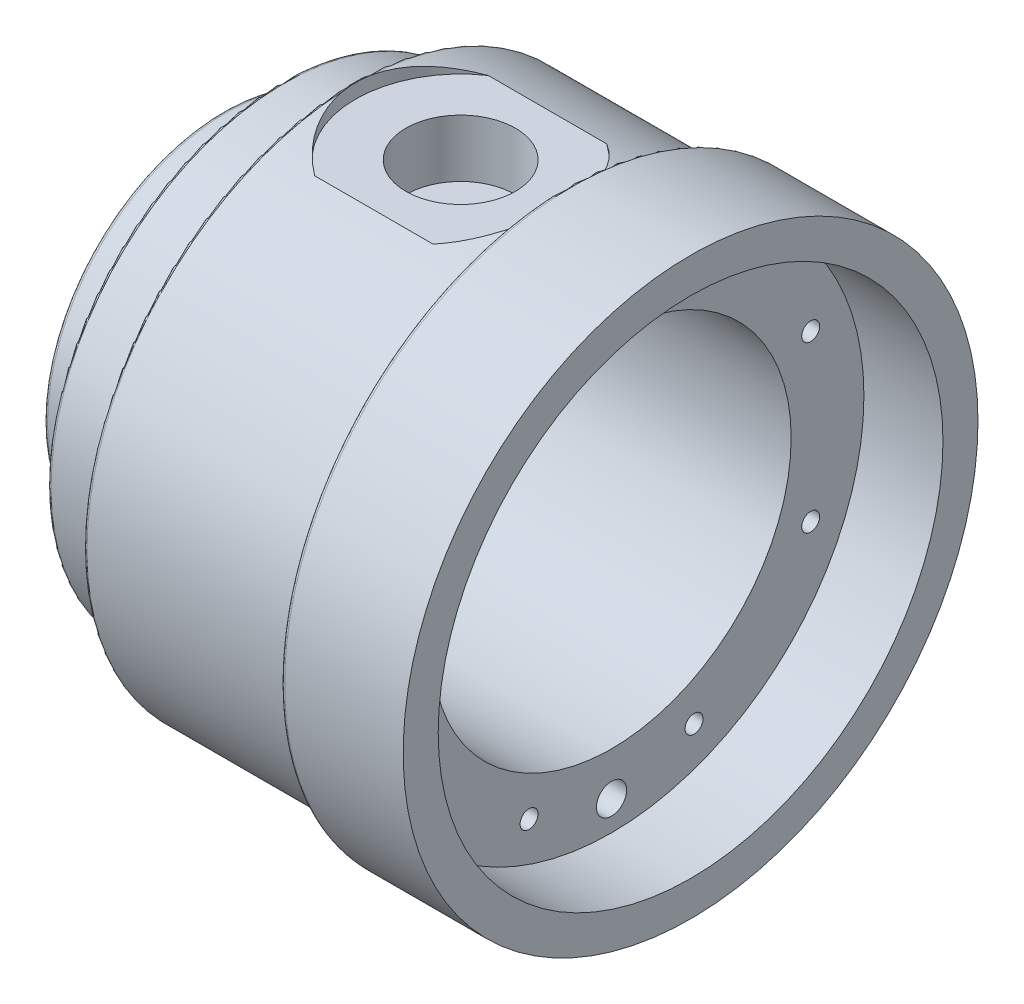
ISO-10303-21;
HEADER;
FILE_DESCRIPTION(('STEP AP214'),'2;1');
FILE_NAME('part.step','',(''),(''),'','','');
FILE_SCHEMA(('AUTOMOTIVE_DESIGN { 1 0 10303 214 1 1 1 1 }'));
ENDSEC;
DATA;
#1=APPLICATION_CONTEXT('core data for automotive mechanical design processes');
#2=APPLICATION_PROTOCOL_DEFINITION('international standard','automotive_design',2000,#1);
#3=PRODUCT_CONTEXT('',#1,'mechanical');
#4=PRODUCT('Part','Part','',(#3));
#5=PRODUCT_RELATED_PRODUCT_CATEGORY('part','',(#4));
#6=PRODUCT_DEFINITION_FORMATION('','',#4);
#7=PRODUCT_DEFINITION_CONTEXT('part definition',#1,'design');
#8=PRODUCT_DEFINITION('design','',#6,#7);
#9=PRODUCT_DEFINITION_SHAPE('','',#8);
#10=(LENGTH_UNIT() NAMED_UNIT(*) SI_UNIT(.MILLI.,.METRE.));
#11=(NAMED_UNIT(*) PLANE_ANGLE_UNIT() SI_UNIT($,.RADIAN.));
#12=(NAMED_UNIT(*) SI_UNIT($,.STERADIAN.) SOLID_ANGLE_UNIT());
#13=UNCERTAINTY_MEASURE_WITH_UNIT(LENGTH_MEASURE(1.E-05),#10,'distance_accuracy_value','');
#14=(GEOMETRIC_REPRESENTATION_CONTEXT(3) GLOBAL_UNCERTAINTY_ASSIGNED_CONTEXT((#13)) GLOBAL_UNIT_ASSIGNED_CONTEXT((#10,
#11,#12)) REPRESENTATION_CONTEXT('',''));
#15=CARTESIAN_POINT('',(0.,0.,0.));
#16=DIRECTION('',(0.,0.,1.));
#17=DIRECTION('',(1.,0.,0.));
#18=AXIS2_PLACEMENT_3D('',#15,#16,#17);
#19=CARTESIAN_POINT('',(-52.8,0.,0.));
#20=DIRECTION('',(1.,0.,0.));
#21=DIRECTION('',(0.,0.,-1.));
#22=AXIS2_PLACEMENT_3D('',#19,#20,#21);
#23=CYLINDRICAL_SURFACE('',#22,17.6);
#24=CARTESIAN_POINT('',(-52.,0.,0.));
#25=DIRECTION('',(1.,0.,0.));
#26=DIRECTION('',(0.,0.,-1.));
#27=AXIS2_PLACEMENT_3D('',#24,#25,#26);
#28=CIRCLE('',#27,17.6);
#29=CARTESIAN_POINT('',(-52.,5.,-16.8748333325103));
#30=VERTEX_POINT('',#29);
#31=CARTESIAN_POINT('',(-52.,5.,16.8748333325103));
#32=VERTEX_POINT('',#31);
#33=EDGE_CURVE('E331',#30,#32,#28,.T.);
#34=ORIENTED_EDGE('',*,*,#33,.T.);
#35=DIRECTION('',(1.,0.,0.));
#36=VECTOR('',#35,1.);
#37=CARTESIAN_POINT('',(-52.8,5.,16.8748333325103));
#38=LINE('',#37,#36);
#39=CARTESIAN_POINT('',(-52.8,5.,16.8748333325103));
#40=VERTEX_POINT('',#39);
#41=EDGE_CURVE('E999',#32,#40,#38,.F.);
#42=ORIENTED_EDGE('',*,*,#41,.T.);
#43=CARTESIAN_POINT('',(-52.8,0.,0.));
#44=DIRECTION('',(1.,0.,0.));
#45=DIRECTION('',(0.,0.,-1.));
#46=AXIS2_PLACEMENT_3D('',#43,#44,#45);
#47=CIRCLE('',#46,17.6);
#48=CARTESIAN_POINT('',(-52.8,5.,-16.8748333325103));
#49=VERTEX_POINT('',#48);
#50=EDGE_CURVE('E340',#49,#40,#47,.T.);
#51=ORIENTED_EDGE('',*,*,#50,.F.);
#52=DIRECTION('',(1.,0.,0.));
#53=VECTOR('',#52,1.);
#54=CARTESIAN_POINT('',(-52.8,5.,-16.8748333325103));
#55=LINE('',#54,#53);
#56=EDGE_CURVE('E996',#49,#30,#55,.T.);
#57=ORIENTED_EDGE('',*,*,#56,.T.);
#58=EDGE_LOOP('',(#34,#42,#51,#57));
#59=FACE_BOUND('',#58,.T.);
#60=ADVANCED_FACE('F34',(#59),#23,.F.);
#61=CARTESIAN_POINT('',(-52.8,0.,0.));
#62=DIRECTION('',(1.,0.,0.));
#63=DIRECTION('',(0.,0.,-1.));
#64=AXIS2_PLACEMENT_3D('',#61,#62,#63);
#65=PLANE('',#64);
#66=DIRECTION('',(0.,0.,1.));
#67=VECTOR('',#66,1.);
#68=CARTESIAN_POINT('',(-52.8,5.,0.));
#69=LINE('',#68,#67);
#70=EDGE_CURVE('E367',#49,#40,#69,.T.);
#71=ORIENTED_EDGE('',*,*,#70,.F.);
#72=ORIENTED_EDGE('',*,*,#50,.T.);
#73=EDGE_LOOP('',(#71,#72));
#74=FACE_BOUND('',#73,.T.);
#75=CARTESIAN_POINT('',(-52.8,12.495,0.));
#76=DIRECTION('',(1.,0.,0.));
#77=DIRECTION('',(0.,0.,-1.));
#78=AXIS2_PLACEMENT_3D('',#75,#76,#77);
#79=CIRCLE('',#78,2.75);
#80=CARTESIAN_POINT('',(-52.8,12.495,-2.75));
#81=VERTEX_POINT('',#80);
#82=EDGE_CURVE('E332',#81,#81,#79,.T.);
#83=ORIENTED_EDGE('',*,*,#82,.F.);
#84=EDGE_LOOP('',(#83));
#85=FACE_BOUND('',#84,.T.);
#86=ADVANCED_FACE('F296',(#74,#85),#65,.T.);
#87=CARTESIAN_POINT('',(-57.,0.,0.));
#88=DIRECTION('',(-1.,0.,0.));
#89=DIRECTION('',(0.,0.,1.));
#90=AXIS2_PLACEMENT_3D('',#87,#88,#89);
#91=PLANE('',#90);
#92=CARTESIAN_POINT('',(-57.,0.,0.));
#93=DIRECTION('',(-1.,0.,0.));
#94=DIRECTION('',(0.,0.,1.));
#95=AXIS2_PLACEMENT_3D('',#92,#93,#94);
#96=CIRCLE('',#95,32.);
#97=CARTESIAN_POINT('',(-57.,0.,32.));
#98=VERTEX_POINT('',#97);
#99=EDGE_CURVE('E375',#98,#98,#96,.T.);
#100=ORIENTED_EDGE('',*,*,#99,.T.);
#101=EDGE_LOOP('',(#100));
#102=FACE_BOUND('',#101,.T.);
#103=CARTESIAN_POINT('',(-57.,0.,0.));
#104=DIRECTION('',(-1.,0.,0.));
#105=DIRECTION('',(0.,0.,1.));
#106=AXIS2_PLACEMENT_3D('',#103,#104,#105);
#107=CIRCLE('',#106,25.);
#108=CARTESIAN_POINT('',(-57.,0.,25.));
#109=VERTEX_POINT('',#108);
#110=EDGE_CURVE('E351',#109,#109,#107,.T.);
#111=ORIENTED_EDGE('',*,*,#110,.F.);
#112=EDGE_LOOP('',(#111));
#113=FACE_BOUND('',#112,.T.);
#114=ADVANCED_FACE('F303',(#102,#113),#91,.T.);
#115=CARTESIAN_POINT('',(-47.,0.,0.));
#116=DIRECTION('',(-1.,0.,0.));
#117=DIRECTION('',(0.,0.,1.));
#118=AXIS2_PLACEMENT_3D('',#115,#116,#117);
#119=PLANE('',#118);
#120=CARTESIAN_POINT('',(-47.,0.,0.));
#121=DIRECTION('',(-1.,0.,0.));
#122=DIRECTION('',(0.,0.,1.));
#123=AXIS2_PLACEMENT_3D('',#120,#121,#122);
#124=CIRCLE('',#123,37.);
#125=CARTESIAN_POINT('',(-47.,0.,37.));
#126=VERTEX_POINT('',#125);
#127=EDGE_CURVE('E381',#126,#126,#124,.T.);
#128=ORIENTED_EDGE('',*,*,#127,.T.);
#129=EDGE_LOOP('',(#128));
#130=FACE_BOUND('',#129,.T.);
#131=CARTESIAN_POINT('',(-47.,0.,0.));
#132=DIRECTION('',(-1.,0.,0.));
#133=DIRECTION('',(0.,0.,1.));
#134=AXIS2_PLACEMENT_3D('',#131,#132,#133);
#135=CIRCLE('',#134,32.5);
#136=CARTESIAN_POINT('',(-47.,0.,32.5));
#137=VERTEX_POINT('',#136);
#138=EDGE_CURVE('E356',#137,#137,#135,.T.);
#139=ORIENTED_EDGE('',*,*,#138,.F.);
#140=EDGE_LOOP('',(#139));
#141=FACE_BOUND('',#140,.T.);
#142=ADVANCED_FACE('F443',(#130,#141),#119,.T.);
#143=CARTESIAN_POINT('',(-17.,0.,0.));
#144=DIRECTION('',(1.,0.,0.));
#145=DIRECTION('',(0.,0.,-1.));
#146=AXIS2_PLACEMENT_3D('',#143,#144,#145);
#147=PLANE('',#146);
#148=CARTESIAN_POINT('',(-17.,0.,0.));
#149=DIRECTION('',(1.,0.,0.));
#150=DIRECTION('',(0.,0.,-1.));
#151=AXIS2_PLACEMENT_3D('',#148,#149,#150);
#152=CIRCLE('',#151,39.5);
#153=CARTESIAN_POINT('',(-17.,0.,-39.5));
#154=VERTEX_POINT('',#153);
#155=EDGE_CURVE('E390',#154,#154,#152,.F.);
#156=ORIENTED_EDGE('',*,*,#155,.T.);
#157=EDGE_LOOP('',(#156));
#158=FACE_BOUND('',#157,.T.);
#159=CARTESIAN_POINT('',(-17.,0.,0.));
#160=DIRECTION('',(1.,0.,0.));
#161=DIRECTION('',(0.,0.,-1.));
#162=AXIS2_PLACEMENT_3D('',#159,#160,#161);
#163=CIRCLE('',#162,37.5);
#164=CARTESIAN_POINT('',(-17.,0.,-37.5));
#165=VERTEX_POINT('',#164);
#166=EDGE_CURVE('E362',#165,#165,#163,.F.);
#167=ORIENTED_EDGE('',*,*,#166,.F.);
#168=EDGE_LOOP('',(#167));
#169=FACE_BOUND('',#168,.T.);
#170=ADVANCED_FACE('F445',(#158,#169),#147,.F.);
#171=CARTESIAN_POINT('',(-17.,0.,0.));
#172=DIRECTION('',(1.,0.,0.));
#173=DIRECTION('',(0.,0.,-1.));
#174=AXIS2_PLACEMENT_3D('',#171,#172,#173);
#175=CYLINDRICAL_SURFACE('',#174,40.);
#176=CARTESIAN_POINT('',(-16.5,0.,0.));
#177=DIRECTION('',(1.,0.,0.));
#178=DIRECTION('',(0.,0.,-1.));
#179=AXIS2_PLACEMENT_3D('',#176,#177,#178);
#180=CIRCLE('',#179,40.);
#181=CARTESIAN_POINT('',(-16.5,0.,-40.));
#182=VERTEX_POINT('',#181);
#183=EDGE_CURVE('E387',#182,#182,#180,.T.);
#184=ORIENTED_EDGE('',*,*,#183,.T.);
#185=EDGE_LOOP('',(#184));
#186=FACE_BOUND('',#185,.T.);
#187=CARTESIAN_POINT('',(0.,0.,0.));
#188=DIRECTION('',(1.,0.,0.));
#189=DIRECTION('',(0.,0.,-1.));
#190=AXIS2_PLACEMENT_3D('',#187,#188,#189);
#191=CIRCLE('',#190,40.);
#192=CARTESIAN_POINT('',(0.,0.,-40.));
#193=VERTEX_POINT('',#192);
#194=EDGE_CURVE('E359',#193,#193,#191,.T.);
#195=ORIENTED_EDGE('',*,*,#194,.F.);
#196=EDGE_LOOP('',(#195));
#197=FACE_BOUND('',#196,.T.);
#198=ADVANCED_FACE('F542',(#186,#197),#175,.T.);
#199=CARTESIAN_POINT('',(0.,0.,0.));
#200=DIRECTION('',(1.,0.,0.));
#201=DIRECTION('',(0.,0.,-1.));
#202=AXIS2_PLACEMENT_3D('',#199,#200,#201);
#203=PLANE('',#202);
#204=CARTESIAN_POINT('',(0.,0.,0.));
#205=DIRECTION('',(1.,0.,0.));
#206=DIRECTION('',(0.,0.,-1.));
#207=AXIS2_PLACEMENT_3D('',#204,#205,#206);
#208=CIRCLE('',#207,35.125);
#209=CARTESIAN_POINT('',(0.,0.,-35.125));
#210=VERTEX_POINT('',#209);
#211=EDGE_CURVE('E344',#210,#210,#208,.T.);
#212=ORIENTED_EDGE('',*,*,#211,.F.);
#213=EDGE_LOOP('',(#212));
#214=FACE_BOUND('',#213,.T.);
#215=ORIENTED_EDGE('',*,*,#194,.T.);
#216=EDGE_LOOP('',(#215));
#217=FACE_BOUND('',#216,.T.);
#218=ADVANCED_FACE('F442',(#214,#217),#203,.T.);
#219=CARTESIAN_POINT('',(-47.,0.,0.));
#220=DIRECTION('',(1.,0.,0.));
#221=DIRECTION('',(0.,0.,-1.));
#222=AXIS2_PLACEMENT_3D('',#219,#220,#221);
#223=CYLINDRICAL_SURFACE('',#222,37.5);
#224=CARTESIAN_POINT('',(-46.5,0.,0.));
#225=DIRECTION('',(-1.,0.,0.));
#226=DIRECTION('',(0.,0.,1.));
#227=AXIS2_PLACEMENT_3D('',#224,#225,#226);
#228=CIRCLE('',#227,37.5);
#229=CARTESIAN_POINT('',(-46.5,37.4514268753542,1.90804219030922));
#230=VERTEX_POINT('',#229);
#231=CARTESIAN_POINT('',(-46.5,-37.4514268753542,1.90804219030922));
#232=VERTEX_POINT('',#231);
#233=EDGE_CURVE('E384',#230,#232,#228,.F.);
#234=ORIENTED_EDGE('',*,*,#233,.T.);
#235=CARTESIAN_POINT('',(-46.5,-37.4514268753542,1.90804219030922));
#236=CARTESIAN_POINT('',(-46.47366008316,-37.4412307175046,2.10821442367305));
#237=CARTESIAN_POINT('',(-46.4431873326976,-37.4294542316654,2.30773408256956));
#238=CARTESIAN_POINT('',(-46.3740579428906,-37.4028324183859,2.70513682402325));
#239=CARTESIAN_POINT('',(-46.3354016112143,-37.3879872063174,2.90301996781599));
#240=CARTESIAN_POINT('',(-46.2073272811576,-37.3390042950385,3.49350573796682));
#241=CARTESIAN_POINT('',(-46.1057724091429,-37.3004069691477,3.88318365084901));
#242=CARTESIAN_POINT('',(-45.871640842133,-37.2124989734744,4.65068115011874));
#243=CARTESIAN_POINT('',(-45.7391443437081,-37.1632160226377,5.02852857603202));
#244=CARTESIAN_POINT('',(-45.4441867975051,-37.0551846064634,5.77096252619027));
#245=CARTESIAN_POINT('',(-45.2817242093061,-36.9964356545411,6.13554836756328));
#246=CARTESIAN_POINT('',(-44.9283920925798,-36.8710652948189,6.84876153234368));
#247=CARTESIAN_POINT('',(-44.7375525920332,-36.80445222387,7.19740522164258));
#248=CARTESIAN_POINT('',(-44.3287766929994,-36.6649860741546,7.87713079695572));
#249=CARTESIAN_POINT('',(-44.1108385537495,-36.5921325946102,8.20821155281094));
#250=CARTESIAN_POINT('',(-43.6493883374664,-36.4420092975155,8.85092435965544));
#251=CARTESIAN_POINT('',(-43.4058786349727,-36.3647398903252,9.16255821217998));
#252=CARTESIAN_POINT('',(-42.8948696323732,-36.2077126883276,9.76464778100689));
#253=CARTESIAN_POINT('',(-42.6273765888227,-36.127955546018,10.0551089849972));
#254=CARTESIAN_POINT('',(-42.0253587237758,-35.9551296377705,10.6579535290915));
#255=CARTESIAN_POINT('',(-41.6869477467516,-35.8619669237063,10.9664427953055));
#256=CARTESIAN_POINT('',(-40.9830377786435,-35.678272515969,11.5500875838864));
#257=CARTESIAN_POINT('',(-40.6175939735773,-35.587735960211,11.8253081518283));
#258=CARTESIAN_POINT('',(-40.2395767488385,-35.5,12.0830459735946));
#259=B_SPLINE_CURVE_WITH_KNOTS('',3,(#235,#236,#237,#238,#239,#240,#241,#242,#243,#244,#245,
#246,#247,#248,#249,#250,#251,#252,#253,#254,#255,#256,#257,#258),.UNSPECIFIED.,.F.,.F.,(4,2,2,
2,2,2,2,2,2,2,2,4),(0.,0.606361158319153,1.21269952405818,2.42465476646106,3.6335029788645,
4.84241335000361,6.05005345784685,7.25777118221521,8.46537685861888,9.67266841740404,
11.0725442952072,12.4696373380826),.UNSPECIFIED.);
#260=CARTESIAN_POINT('',(-40.2395767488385,-35.5,12.0830459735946));
#261=VERTEX_POINT('',#260);
#262=EDGE_CURVE('E49',#232,#261,#259,.T.);
#263=ORIENTED_EDGE('',*,*,#262,.T.);
#264=DIRECTION('',(1.,0.,0.));
#265=VECTOR('',#264,1.);
#266=CARTESIAN_POINT('',(-47.,-35.5,12.0830459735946));
#267=LINE('',#266,#265);
#268=CARTESIAN_POINT('',(-23.7604232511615,-35.5,12.0830459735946));
#269=VERTEX_POINT('',#268);
#270=EDGE_CURVE('E11',#269,#261,#267,.F.);
#271=ORIENTED_EDGE('',*,*,#270,.F.);
#272=CARTESIAN_POINT('',(-23.7604232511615,-35.5,12.0830459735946));
#273=CARTESIAN_POINT('',(-23.4168180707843,-35.5797492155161,11.848757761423));
#274=CARTESIAN_POINT('',(-23.0836146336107,-35.6618088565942,11.600052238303));
#275=CARTESIAN_POINT('',(-22.4398875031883,-35.8281797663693,11.0755189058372));
#276=CARTESIAN_POINT('',(-22.1293637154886,-35.9124910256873,10.7996912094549));
#277=CARTESIAN_POINT('',(-21.5323488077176,-36.0811436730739,10.2221203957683));
#278=CARTESIAN_POINT('',(-21.2459005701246,-36.1654848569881,9.92033289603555));
#279=CARTESIAN_POINT('',(-20.6994473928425,-36.3317232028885,9.29306928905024));
#280=CARTESIAN_POINT('',(-20.4394422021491,-36.4136203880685,8.96759340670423));
#281=CARTESIAN_POINT('',(-19.9474007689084,-36.5728076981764,8.29454189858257));
#282=CARTESIAN_POINT('',(-19.7153933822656,-36.6500930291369,7.94694402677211));
#283=CARTESIAN_POINT('',(-19.2814242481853,-36.7978247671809,7.23209979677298));
#284=CARTESIAN_POINT('',(-19.0794609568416,-36.8682715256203,6.8648544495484));
#285=CARTESIAN_POINT('',(-18.7074460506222,-37.0002856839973,6.11344497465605));
#286=CARTESIAN_POINT('',(-18.5373639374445,-37.0618615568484,5.72929745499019));
#287=CARTESIAN_POINT('',(-18.2304630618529,-37.1744418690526,4.94643454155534));
#288=CARTESIAN_POINT('',(-18.0936428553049,-37.2254467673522,4.54771978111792));
#289=CARTESIAN_POINT('',(-17.8586436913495,-37.3138832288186,3.75218789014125));
#290=CARTESIAN_POINT('',(-17.7593289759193,-37.3517104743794,3.35575030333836));
#291=CARTESIAN_POINT('',(-17.5941077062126,-37.4150140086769,2.55499500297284));
#292=CARTESIAN_POINT('',(-17.5282005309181,-37.4404905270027,2.15067743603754));
#293=CARTESIAN_POINT('',(-17.4305151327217,-37.4783568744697,1.33734551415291));
#294=CARTESIAN_POINT('',(-17.3987354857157,-37.4907472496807,0.928331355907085));
#295=CARTESIAN_POINT('',(-17.3696608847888,-37.502080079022,0.108900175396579));
#296=CARTESIAN_POINT('',(-17.3723645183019,-37.5010230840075,-0.301516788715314));
#297=CARTESIAN_POINT('',(-17.4110767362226,-37.4859411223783,-1.09696168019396));
#298=CARTESIAN_POINT('',(-17.4451708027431,-37.4726616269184,-1.48209863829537));
#299=CARTESIAN_POINT('',(-17.5436294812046,-37.4345290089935,-2.24788675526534));
#300=CARTESIAN_POINT('',(-17.607992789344,-37.4096763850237,-2.62853810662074));
#301=CARTESIAN_POINT('',(-17.7663564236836,-37.3490380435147,-3.3826695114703));
#302=CARTESIAN_POINT('',(-17.8603525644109,-37.3132538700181,-3.75615056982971));
#303=CARTESIAN_POINT('',(-18.0771245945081,-37.2316499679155,-4.49353498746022));
#304=CARTESIAN_POINT('',(-18.1999010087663,-37.185830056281,-4.85743817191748));
#305=CARTESIAN_POINT('',(-18.4741914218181,-37.0849092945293,-5.57603122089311));
#306=CARTESIAN_POINT('',(-18.6259103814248,-37.0297425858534,-5.9306335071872));
#307=CARTESIAN_POINT('',(-18.9562830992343,-36.9117072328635,-6.62571941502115));
#308=CARTESIAN_POINT('',(-19.1349373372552,-36.8488384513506,-6.96620278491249));
#309=CARTESIAN_POINT('',(-19.5179319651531,-36.716877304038,-7.63124443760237));
#310=CARTESIAN_POINT('',(-19.7222790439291,-36.6477833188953,-7.95579854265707));
#311=CARTESIAN_POINT('',(-20.1553622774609,-36.5049725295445,-8.58730611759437));
#312=CARTESIAN_POINT('',(-20.3841073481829,-36.4312540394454,-8.89425308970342));
#313=CARTESIAN_POINT('',(-20.8488271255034,-36.2858453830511,-9.46940260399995));
#314=CARTESIAN_POINT('',(-21.0833507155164,-36.2143378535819,-9.73882617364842));
#315=CARTESIAN_POINT('',(-21.5713169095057,-36.0702435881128,-10.2596559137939));
#316=CARTESIAN_POINT('',(-21.8247596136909,-35.9976568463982,-10.5110619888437));
#317=CARTESIAN_POINT('',(-22.3490456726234,-35.8529903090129,-10.9943908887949));
#318=CARTESIAN_POINT('',(-22.6198643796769,-35.780909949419,-11.2263402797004));
#319=CARTESIAN_POINT('',(-23.178041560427,-35.6386512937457,-11.6700845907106));
#320=CARTESIAN_POINT('',(-23.4654012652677,-35.5684731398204,-11.8818780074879));
#321=CARTESIAN_POINT('',(-23.7604232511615,-35.5,-12.0830459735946));
#322=B_SPLINE_CURVE_WITH_KNOTS('',3,(#272,#273,#274,#275,#276,#277,#278,#279,#280,#281,#282,
#283,#284,#285,#286,#287,#288,#289,#290,#291,#292,#293,#294,#295,#296,#297,#298,#299,#300,#301,
#302,#303,#304,#305,#306,#307,#308,#309,#310,#311,#312,#313,#314,#315,#316,#317,#318,#319,#320,
#321),.UNSPECIFIED.,.F.,.F.,(4,2,2,2,2,2,2,2,2,2,2,2,2,2,2,2,2,2,2,2,2,2,2,2,4),(0.,
1.2699541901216,2.53990309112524,3.81206804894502,5.08422092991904,6.35767395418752,
7.63106151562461,8.90322463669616,10.1753325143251,11.4050480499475,12.6347407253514,
13.8643820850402,15.0939730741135,16.2532084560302,17.4123939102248,18.5714157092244,
19.7304586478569,20.8980365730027,22.0656352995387,23.2335386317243,24.4018702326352,
25.4937954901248,26.5857265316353,27.6761415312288,28.7666377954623),.UNSPECIFIED.);
#323=CARTESIAN_POINT('',(-23.7604232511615,-35.5,-12.0830459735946));
#324=VERTEX_POINT('',#323);
#325=EDGE_CURVE('E464',#269,#324,#322,.T.);
#326=ORIENTED_EDGE('',*,*,#325,.T.);
#327=DIRECTION('',(1.,0.,0.));
#328=VECTOR('',#327,1.);
#329=CARTESIAN_POINT('',(-47.,-35.5,-12.0830459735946));
#330=LINE('',#329,#328);
#331=CARTESIAN_POINT('',(-40.2395767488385,-35.5,-12.0830459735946));
#332=VERTEX_POINT('',#331);
#333=EDGE_CURVE('E42',#332,#324,#330,.T.);
#334=ORIENTED_EDGE('',*,*,#333,.F.);
#335=CARTESIAN_POINT('',(-40.2395767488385,-35.5,-12.0830459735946));
#336=CARTESIAN_POINT('',(-40.5829760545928,-35.5797014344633,-11.8488980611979));
#337=CARTESIAN_POINT('',(-40.915985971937,-35.661710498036,-11.6003502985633));
#338=CARTESIAN_POINT('',(-41.5593644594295,-35.8279815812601,-11.076155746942));
#339=CARTESIAN_POINT('',(-41.869732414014,-35.9122436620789,-10.8005082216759));
#340=CARTESIAN_POINT('',(-42.4668141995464,-36.0808992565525,-10.2229875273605));
#341=CARTESIAN_POINT('',(-42.7534564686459,-36.1652924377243,-9.92104027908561));
#342=CARTESIAN_POINT('',(-43.300258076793,-36.3316304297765,-9.29343797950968));
#343=CARTESIAN_POINT('',(-43.5604185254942,-36.4135753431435,-8.96778392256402));
#344=CARTESIAN_POINT('',(-44.0528300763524,-36.5728823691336,-8.2942261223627));
#345=CARTESIAN_POINT('',(-44.2850417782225,-36.6502379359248,-7.94629200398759));
#346=CARTESIAN_POINT('',(-44.7193615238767,-36.7980954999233,-7.23074049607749));
#347=CARTESIAN_POINT('',(-44.9214711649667,-36.8685978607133,-6.8631241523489));
#348=CARTESIAN_POINT('',(-45.2934059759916,-37.0005924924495,-6.11157113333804));
#349=CARTESIAN_POINT('',(-45.4633143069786,-37.0621078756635,-5.72767971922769));
#350=CARTESIAN_POINT('',(-45.769853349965,-37.1745604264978,-4.94551471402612));
#351=CARTESIAN_POINT('',(-45.9064996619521,-37.2255025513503,-4.54724796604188));
#352=CARTESIAN_POINT('',(-46.1335963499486,-37.3109610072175,-3.77844771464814));
#353=CARTESIAN_POINT('',(-46.2272457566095,-37.3465925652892,-3.40898078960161));
#354=CARTESIAN_POINT('',(-46.3855491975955,-37.4072002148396,-2.66312467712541));
#355=CARTESIAN_POINT('',(-46.4502099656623,-37.4321787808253,-2.28673711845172));
#356=CARTESIAN_POINT('',(-46.5,-37.4514268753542,-1.90804219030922));
#357=B_SPLINE_CURVE_WITH_KNOTS('',3,(#335,#336,#337,#338,#339,#340,#341,#342,#343,#344,#345,
#346,#347,#348,#349,#350,#351,#352,#353,#354,#355,#356),.UNSPECIFIED.,.F.,.F.,(4,2,2,2,2,2,2,2,
2,2,4),(0.,1.2691934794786,2.53842145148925,3.81134786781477,5.08422092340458,6.35886787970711,
7.63344717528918,8.904688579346,10.1753326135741,11.3224831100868,12.4693669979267),.UNSPECIFIED.);
#358=CARTESIAN_POINT('',(-46.5,-37.4514268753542,-1.90804219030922));
#359=VERTEX_POINT('',#358);
#360=EDGE_CURVE('E454',#332,#359,#357,.T.);
#361=ORIENTED_EDGE('',*,*,#360,.T.);
#362=CARTESIAN_POINT('',(-46.5,37.4514268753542,-1.90804219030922));
#363=VERTEX_POINT('',#362);
#364=EDGE_CURVE('E57',#359,#363,#228,.F.);
#365=ORIENTED_EDGE('',*,*,#364,.T.);
#366=CARTESIAN_POINT('',(-46.5,37.4514268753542,-1.90804219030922));
#367=CARTESIAN_POINT('',(-46.47366008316,37.4412307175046,-2.10821442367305));
#368=CARTESIAN_POINT('',(-46.4431873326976,37.4294542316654,-2.30773408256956));
#369=CARTESIAN_POINT('',(-46.3740579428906,37.4028324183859,-2.70513682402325));
#370=CARTESIAN_POINT('',(-46.3354016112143,37.3879872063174,-2.90301996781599));
#371=CARTESIAN_POINT('',(-46.2073272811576,37.3390042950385,-3.49350573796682));
#372=CARTESIAN_POINT('',(-46.1057724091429,37.3004069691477,-3.88318365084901));
#373=CARTESIAN_POINT('',(-45.871640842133,37.2124989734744,-4.65068115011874));
#374=CARTESIAN_POINT('',(-45.7391443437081,37.1632160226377,-5.02852857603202));
#375=CARTESIAN_POINT('',(-45.4441867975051,37.0551846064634,-5.77096252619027));
#376=CARTESIAN_POINT('',(-45.2817242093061,36.9964356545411,-6.13554836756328));
#377=CARTESIAN_POINT('',(-44.9283920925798,36.8710652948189,-6.84876153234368));
#378=CARTESIAN_POINT('',(-44.7375525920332,36.80445222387,-7.19740522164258));
#379=CARTESIAN_POINT('',(-44.3287766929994,36.6649860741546,-7.87713079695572));
#380=CARTESIAN_POINT('',(-44.1108385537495,36.5921325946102,-8.20821155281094));
#381=CARTESIAN_POINT('',(-43.6493883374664,36.4420092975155,-8.85092435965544));
#382=CARTESIAN_POINT('',(-43.4058786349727,36.3647398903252,-9.16255821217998));
#383=CARTESIAN_POINT('',(-42.8948696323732,36.2077126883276,-9.76464778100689));
#384=CARTESIAN_POINT('',(-42.6273765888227,36.127955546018,-10.0551089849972));
#385=CARTESIAN_POINT('',(-42.0253587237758,35.9551296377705,-10.6579535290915));
#386=CARTESIAN_POINT('',(-41.6869477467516,35.8619669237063,-10.9664427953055));
#387=CARTESIAN_POINT('',(-40.9830377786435,35.678272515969,-11.5500875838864));
#388=CARTESIAN_POINT('',(-40.6175939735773,35.587735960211,-11.8253081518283));
#389=CARTESIAN_POINT('',(-40.2395767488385,35.5,-12.0830459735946));
#390=B_SPLINE_CURVE_WITH_KNOTS('',3,(#366,#367,#368,#369,#370,#371,#372,#373,#374,#375,#376,
#377,#378,#379,#380,#381,#382,#383,#384,#385,#386,#387,#388,#389),.UNSPECIFIED.,.F.,.F.,(4,2,2,
2,2,2,2,2,2,2,2,4),(0.,0.606361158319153,1.21269952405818,2.42465476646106,3.6335029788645,
4.84241335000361,6.05005345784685,7.25777118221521,8.46537685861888,9.67266841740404,
11.0725442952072,12.4696373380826),.UNSPECIFIED.);
#391=CARTESIAN_POINT('',(-40.2395767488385,35.5,-12.0830459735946));
#392=VERTEX_POINT('',#391);
#393=EDGE_CURVE('E427',#363,#392,#390,.T.);
#394=ORIENTED_EDGE('',*,*,#393,.T.);
#395=DIRECTION('',(1.,0.,0.));
#396=VECTOR('',#395,1.);
#397=CARTESIAN_POINT('',(-47.,35.5,-12.0830459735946));
#398=LINE('',#397,#396);
#399=CARTESIAN_POINT('',(-23.7604232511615,35.5,-12.0830459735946));
#400=VERTEX_POINT('',#399);
#401=EDGE_CURVE('E487',#400,#392,#398,.F.);
#402=ORIENTED_EDGE('',*,*,#401,.F.);
#403=CARTESIAN_POINT('',(-23.7604232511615,35.5,-12.0830459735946));
#404=CARTESIAN_POINT('',(-23.4168180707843,35.5797492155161,-11.848757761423));
#405=CARTESIAN_POINT('',(-23.0836146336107,35.6618088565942,-11.600052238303));
#406=CARTESIAN_POINT('',(-22.4398875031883,35.8281797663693,-11.0755189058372));
#407=CARTESIAN_POINT('',(-22.1293637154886,35.9124910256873,-10.7996912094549));
#408=CARTESIAN_POINT('',(-21.5323488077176,36.0811436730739,-10.2221203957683));
#409=CARTESIAN_POINT('',(-21.2459005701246,36.1654848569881,-9.92033289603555));
#410=CARTESIAN_POINT('',(-20.6994473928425,36.3317232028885,-9.29306928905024));
#411=CARTESIAN_POINT('',(-20.4394422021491,36.4136203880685,-8.96759340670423));
#412=CARTESIAN_POINT('',(-19.9474007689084,36.5728076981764,-8.29454189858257));
#413=CARTESIAN_POINT('',(-19.7153933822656,36.6500930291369,-7.94694402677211));
#414=CARTESIAN_POINT('',(-19.2814242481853,36.7978247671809,-7.23209979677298));
#415=CARTESIAN_POINT('',(-19.0794609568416,36.8682715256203,-6.8648544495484));
#416=CARTESIAN_POINT('',(-18.7074460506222,37.0002856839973,-6.11344497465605));
#417=CARTESIAN_POINT('',(-18.5373639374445,37.0618615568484,-5.72929745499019));
#418=CARTESIAN_POINT('',(-18.2304630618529,37.1744418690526,-4.94643454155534));
#419=CARTESIAN_POINT('',(-18.0936428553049,37.2254467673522,-4.54771978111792));
#420=CARTESIAN_POINT('',(-17.8586436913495,37.3138832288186,-3.75218789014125));
#421=CARTESIAN_POINT('',(-17.7593289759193,37.3517104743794,-3.35575030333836));
#422=CARTESIAN_POINT('',(-17.5941077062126,37.4150140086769,-2.55499500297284));
#423=CARTESIAN_POINT('',(-17.5282005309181,37.4404905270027,-2.15067743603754));
#424=CARTESIAN_POINT('',(-17.4305151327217,37.4783568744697,-1.33734551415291));
#425=CARTESIAN_POINT('',(-17.3987354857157,37.4907472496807,-0.928331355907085));
#426=CARTESIAN_POINT('',(-17.3696608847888,37.502080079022,-0.108900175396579));
#427=CARTESIAN_POINT('',(-17.3723645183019,37.5010230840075,0.301516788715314));
#428=CARTESIAN_POINT('',(-17.4110767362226,37.4859411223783,1.09696168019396));
#429=CARTESIAN_POINT('',(-17.4451708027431,37.4726616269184,1.48209863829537));
#430=CARTESIAN_POINT('',(-17.5436294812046,37.4345290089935,2.24788675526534));
#431=CARTESIAN_POINT('',(-17.607992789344,37.4096763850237,2.62853810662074));
#432=CARTESIAN_POINT('',(-17.7663564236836,37.3490380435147,3.3826695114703));
#433=CARTESIAN_POINT('',(-17.8603525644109,37.3132538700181,3.75615056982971));
#434=CARTESIAN_POINT('',(-18.0771245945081,37.2316499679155,4.49353498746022));
#435=CARTESIAN_POINT('',(-18.1999010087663,37.185830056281,4.85743817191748));
#436=CARTESIAN_POINT('',(-18.4741914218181,37.0849092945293,5.57603122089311));
#437=CARTESIAN_POINT('',(-18.6259103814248,37.0297425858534,5.9306335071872));
#438=CARTESIAN_POINT('',(-18.9562830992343,36.9117072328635,6.62571941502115));
#439=CARTESIAN_POINT('',(-19.1349373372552,36.8488384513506,6.96620278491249));
#440=CARTESIAN_POINT('',(-19.5179319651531,36.716877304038,7.63124443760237));
#441=CARTESIAN_POINT('',(-19.7222790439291,36.6477833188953,7.95579854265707));
#442=CARTESIAN_POINT('',(-20.1553622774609,36.5049725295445,8.58730611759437));
#443=CARTESIAN_POINT('',(-20.3841073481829,36.4312540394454,8.89425308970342));
#444=CARTESIAN_POINT('',(-20.8488271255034,36.2858453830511,9.46940260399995));
#445=CARTESIAN_POINT('',(-21.0833507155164,36.2143378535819,9.73882617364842));
#446=CARTESIAN_POINT('',(-21.5713169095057,36.0702435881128,10.2596559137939));
#447=CARTESIAN_POINT('',(-21.8247596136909,35.9976568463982,10.5110619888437));
#448=CARTESIAN_POINT('',(-22.3490456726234,35.8529903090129,10.9943908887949));
#449=CARTESIAN_POINT('',(-22.6198643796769,35.780909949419,11.2263402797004));
#450=CARTESIAN_POINT('',(-23.178041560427,35.6386512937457,11.6700845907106));
#451=CARTESIAN_POINT('',(-23.4654012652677,35.5684731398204,11.8818780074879));
#452=CARTESIAN_POINT('',(-23.7604232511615,35.5,12.0830459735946));
#453=B_SPLINE_CURVE_WITH_KNOTS('',3,(#403,#404,#405,#406,#407,#408,#409,#410,#411,#412,#413,
#414,#415,#416,#417,#418,#419,#420,#421,#422,#423,#424,#425,#426,#427,#428,#429,#430,#431,#432,
#433,#434,#435,#436,#437,#438,#439,#440,#441,#442,#443,#444,#445,#446,#447,#448,#449,#450,#451,
#452),.UNSPECIFIED.,.F.,.F.,(4,2,2,2,2,2,2,2,2,2,2,2,2,2,2,2,2,2,2,2,2,2,2,2,4),(0.,
1.2699541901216,2.53990309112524,3.81206804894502,5.08422092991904,6.35767395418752,
7.63106151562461,8.90322463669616,10.1753325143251,11.4050480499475,12.6347407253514,
13.8643820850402,15.0939730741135,16.2532084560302,17.4123939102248,18.5714157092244,
19.7304586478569,20.8980365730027,22.0656352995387,23.2335386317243,24.4018702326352,
25.4937954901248,26.5857265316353,27.6761415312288,28.7666377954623),.UNSPECIFIED.);
#454=CARTESIAN_POINT('',(-23.7604232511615,35.5,12.0830459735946));
#455=VERTEX_POINT('',#454);
#456=EDGE_CURVE('E431',#400,#455,#453,.T.);
#457=ORIENTED_EDGE('',*,*,#456,.T.);
#458=DIRECTION('',(1.,0.,0.));
#459=VECTOR('',#458,1.);
#460=CARTESIAN_POINT('',(-47.,35.5,12.0830459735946));
#461=LINE('',#460,#459);
#462=CARTESIAN_POINT('',(-40.2395767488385,35.5,12.0830459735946));
#463=VERTEX_POINT('',#462);
#464=EDGE_CURVE('E399',#463,#455,#461,.T.);
#465=ORIENTED_EDGE('',*,*,#464,.F.);
#466=CARTESIAN_POINT('',(-40.2395767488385,35.5,12.0830459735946));
#467=CARTESIAN_POINT('',(-40.5829760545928,35.5797014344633,11.8488980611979));
#468=CARTESIAN_POINT('',(-40.915985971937,35.661710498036,11.6003502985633));
#469=CARTESIAN_POINT('',(-41.5593644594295,35.8279815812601,11.076155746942));
#470=CARTESIAN_POINT('',(-41.869732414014,35.9122436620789,10.8005082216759));
#471=CARTESIAN_POINT('',(-42.4668141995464,36.0808992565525,10.2229875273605));
#472=CARTESIAN_POINT('',(-42.7534564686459,36.1652924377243,9.92104027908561));
#473=CARTESIAN_POINT('',(-43.300258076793,36.3316304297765,9.29343797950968));
#474=CARTESIAN_POINT('',(-43.5604185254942,36.4135753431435,8.96778392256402));
#475=CARTESIAN_POINT('',(-44.0528300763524,36.5728823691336,8.2942261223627));
#476=CARTESIAN_POINT('',(-44.2850417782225,36.6502379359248,7.94629200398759));
#477=CARTESIAN_POINT('',(-44.7193615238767,36.7980954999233,7.23074049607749));
#478=CARTESIAN_POINT('',(-44.9214711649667,36.8685978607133,6.8631241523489));
#479=CARTESIAN_POINT('',(-45.2934059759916,37.0005924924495,6.11157113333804));
#480=CARTESIAN_POINT('',(-45.4633143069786,37.0621078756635,5.72767971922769));
#481=CARTESIAN_POINT('',(-45.769853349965,37.1745604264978,4.94551471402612));
#482=CARTESIAN_POINT('',(-45.9064996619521,37.2255025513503,4.54724796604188));
#483=CARTESIAN_POINT('',(-46.1335963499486,37.3109610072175,3.77844771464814));
#484=CARTESIAN_POINT('',(-46.2272457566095,37.3465925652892,3.40898078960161));
#485=CARTESIAN_POINT('',(-46.3855491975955,37.4072002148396,2.66312467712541));
#486=CARTESIAN_POINT('',(-46.4502099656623,37.4321787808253,2.28673711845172));
#487=CARTESIAN_POINT('',(-46.5,37.4514268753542,1.90804219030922));
#488=B_SPLINE_CURVE_WITH_KNOTS('',3,(#466,#467,#468,#469,#470,#471,#472,#473,#474,#475,#476,
#477,#478,#479,#480,#481,#482,#483,#484,#485,#486,#487),.UNSPECIFIED.,.F.,.F.,(4,2,2,2,2,2,2,2,
2,2,4),(0.,1.2691934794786,2.53842145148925,3.81134786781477,5.08422092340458,6.35886787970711,
7.63344717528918,8.904688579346,10.1753326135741,11.3224831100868,12.4693669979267),.UNSPECIFIED.);
#489=EDGE_CURVE('E420',#463,#230,#488,.T.);
#490=ORIENTED_EDGE('',*,*,#489,.T.);
#491=EDGE_LOOP('',(#234,#263,#271,#326,#334,#361,#365,#394,#402,#457,#465,#490));
#492=FACE_BOUND('',#491,.T.);
#493=ORIENTED_EDGE('',*,*,#166,.T.);
#494=EDGE_LOOP('',(#493));
#495=FACE_BOUND('',#494,.T.);
#496=ADVANCED_FACE('F436',(#492,#495),#223,.T.);
#497=CARTESIAN_POINT('',(-57.,0.,0.));
#498=DIRECTION('',(1.,0.,0.));
#499=DIRECTION('',(0.,0.,-1.));
#500=AXIS2_PLACEMENT_3D('',#497,#498,#499);
#501=CYLINDRICAL_SURFACE('',#500,32.5);
#502=CARTESIAN_POINT('',(-56.5,0.,0.));
#503=DIRECTION('',(-1.,0.,0.));
#504=DIRECTION('',(0.,0.,1.));
#505=AXIS2_PLACEMENT_3D('',#502,#503,#504);
#506=CIRCLE('',#505,32.5);
#507=CARTESIAN_POINT('',(-56.5,0.,32.5));
#508=VERTEX_POINT('',#507);
#509=EDGE_CURVE('E378',#508,#508,#506,.F.);
#510=ORIENTED_EDGE('',*,*,#509,.T.);
#511=EDGE_LOOP('',(#510));
#512=FACE_BOUND('',#511,.T.);
#513=ORIENTED_EDGE('',*,*,#138,.T.);
#514=EDGE_LOOP('',(#513));
#515=FACE_BOUND('',#514,.T.);
#516=ADVANCED_FACE('F441',(#512,#515),#501,.T.);
#517=CARTESIAN_POINT('',(-65.,0.,0.));
#518=DIRECTION('',(1.,0.,0.));
#519=DIRECTION('',(0.,0.,-1.));
#520=AXIS2_PLACEMENT_3D('',#517,#518,#519);
#521=CYLINDRICAL_SURFACE('',#520,25.);
#522=CARTESIAN_POINT('',(-64.5,0.,0.));
#523=DIRECTION('',(-1.,0.,0.));
#524=DIRECTION('',(0.,0.,1.));
#525=AXIS2_PLACEMENT_3D('',#522,#523,#524);
#526=CIRCLE('',#525,25.);
#527=CARTESIAN_POINT('',(-64.5,0.,25.));
#528=VERTEX_POINT('',#527);
#529=EDGE_CURVE('E372',#528,#528,#526,.F.);
#530=ORIENTED_EDGE('',*,*,#529,.T.);
#531=EDGE_LOOP('',(#530));
#532=FACE_BOUND('',#531,.T.);
#533=ORIENTED_EDGE('',*,*,#110,.T.);
#534=EDGE_LOOP('',(#533));
#535=FACE_BOUND('',#534,.T.);
#536=ADVANCED_FACE('F572',(#532,#535),#521,.T.);
#537=CARTESIAN_POINT('',(-65.,0.,0.));
#538=DIRECTION('',(-1.,0.,0.));
#539=DIRECTION('',(0.,0.,1.));
#540=AXIS2_PLACEMENT_3D('',#537,#538,#539);
#541=PLANE('',#540);
#542=CARTESIAN_POINT('',(-65.,0.,0.));
#543=DIRECTION('',(-1.,0.,0.));
#544=DIRECTION('',(0.,0.,1.));
#545=AXIS2_PLACEMENT_3D('',#542,#543,#544);
#546=CIRCLE('',#545,24.5);
#547=CARTESIAN_POINT('',(-65.,0.,24.5));
#548=VERTEX_POINT('',#547);
#549=EDGE_CURVE('E369',#548,#548,#546,.T.);
#550=ORIENTED_EDGE('',*,*,#549,.T.);
#551=EDGE_LOOP('',(#550));
#552=FACE_BOUND('',#551,.T.);
#553=CARTESIAN_POINT('',(-65.,-12.495,0.));
#554=DIRECTION('',(1.,0.,0.));
#555=DIRECTION('',(0.,0.,1.));
#556=AXIS2_PLACEMENT_3D('',#553,#554,#555);
#557=CIRCLE('',#556,5.);
#558=CARTESIAN_POINT('',(-65.,-12.495,-5.));
#559=VERTEX_POINT('',#558);
#560=EDGE_CURVE('E1003',#559,#559,#557,.T.);
#561=ORIENTED_EDGE('',*,*,#560,.T.);
#562=EDGE_LOOP('',(#561));
#563=FACE_BOUND('',#562,.T.);
#564=CARTESIAN_POINT('',(-65.,12.495,0.));
#565=DIRECTION('',(1.,0.,0.));
#566=DIRECTION('',(0.,0.,-1.));
#567=AXIS2_PLACEMENT_3D('',#564,#565,#566);
#568=CIRCLE('',#567,5.);
#569=CARTESIAN_POINT('',(-65.,12.495,-5.));
#570=VERTEX_POINT('',#569);
#571=EDGE_CURVE('E1015',#570,#570,#568,.T.);
#572=ORIENTED_EDGE('',*,*,#571,.T.);
#573=EDGE_LOOP('',(#572));
#574=FACE_BOUND('',#573,.T.);
#575=ADVANCED_FACE('F536',(#552,#563,#574),#541,.T.);
#576=CARTESIAN_POINT('',(-11.,0.,0.));
#577=DIRECTION('',(1.,0.,0.));
#578=DIRECTION('',(0.,0.,-1.));
#579=AXIS2_PLACEMENT_3D('',#576,#577,#578);
#580=CYLINDRICAL_SURFACE('',#579,35.125);
#581=CARTESIAN_POINT('',(-11.,0.,0.));
#582=DIRECTION('',(1.,0.,0.));
#583=DIRECTION('',(0.,0.,-1.));
#584=AXIS2_PLACEMENT_3D('',#581,#582,#583);
#585=CIRCLE('',#584,35.125);
#586=CARTESIAN_POINT('',(-11.,0.,-35.125));
#587=VERTEX_POINT('',#586);
#588=EDGE_CURVE('E348',#587,#587,#585,.T.);
#589=ORIENTED_EDGE('',*,*,#588,.F.);
#590=EDGE_LOOP('',(#589));
#591=FACE_BOUND('',#590,.T.);
#592=ORIENTED_EDGE('',*,*,#211,.T.);
#593=EDGE_LOOP('',(#592));
#594=FACE_BOUND('',#593,.T.);
#595=ADVANCED_FACE('F527',(#591,#594),#580,.F.);
#596=CARTESIAN_POINT('',(-11.,0.,0.));
#597=DIRECTION('',(1.,0.,0.));
#598=DIRECTION('',(0.,0.,-1.));
#599=AXIS2_PLACEMENT_3D('',#596,#597,#598);
#600=PLANE('',#599);
#601=CARTESIAN_POINT('',(-11.,11.4805059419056,-27.7163847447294));
#602=DIRECTION('',(1.,0.,0.));
#603=DIRECTION('',(0.,0.,-1.));
#604=AXIS2_PLACEMENT_3D('',#601,#602,#603);
#605=CIRCLE('',#604,1.25);
#606=CARTESIAN_POINT('',(-11.,11.4805059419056,-28.9663847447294));
#607=VERTEX_POINT('',#606);
#608=EDGE_CURVE('E170',#607,#607,#605,.T.);
#609=ORIENTED_EDGE('',*,*,#608,.F.);
#610=EDGE_LOOP('',(#609));
#611=FACE_BOUND('',#610,.T.);
#612=CARTESIAN_POINT('',(-11.,-11.4804999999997,-27.7163872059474));
#613=DIRECTION('',(1.,0.,0.));
#614=DIRECTION('',(0.,0.,-1.));
#615=AXIS2_PLACEMENT_3D('',#612,#613,#614);
#616=CIRCLE('',#615,1.25);
#617=CARTESIAN_POINT('',(-11.,-11.4804999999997,-28.9663872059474));
#618=VERTEX_POINT('',#617);
#619=EDGE_CURVE('E169',#618,#618,#616,.T.);
#620=ORIENTED_EDGE('',*,*,#619,.F.);
#621=EDGE_LOOP('',(#620));
#622=FACE_BOUND('',#621,.T.);
#623=CARTESIAN_POINT('',(-11.,-27.7163847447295,-11.4805059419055));
#624=DIRECTION('',(1.,0.,0.));
#625=DIRECTION('',(0.,0.,-1.));
#626=AXIS2_PLACEMENT_3D('',#623,#624,#625);
#627=CIRCLE('',#626,1.25);
#628=CARTESIAN_POINT('',(-11.,-27.7163847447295,-12.7305059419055));
#629=VERTEX_POINT('',#628);
#630=EDGE_CURVE('E180',#629,#629,#627,.T.);
#631=ORIENTED_EDGE('',*,*,#630,.F.);
#632=EDGE_LOOP('',(#631));
#633=FACE_BOUND('',#632,.T.);
#634=CARTESIAN_POINT('',(-11.,-27.7163872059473,11.4805));
#635=DIRECTION('',(1.,0.,0.));
#636=DIRECTION('',(0.,0.,-1.));
#637=AXIS2_PLACEMENT_3D('',#634,#635,#636);
#638=CIRCLE('',#637,1.25);
#639=CARTESIAN_POINT('',(-11.,-27.7163872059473,10.2305));
#640=VERTEX_POINT('',#639);
#641=EDGE_CURVE('E186',#640,#640,#638,.T.);
#642=ORIENTED_EDGE('',*,*,#641,.F.);
#643=EDGE_LOOP('',(#642));
#644=FACE_BOUND('',#643,.T.);
#645=CARTESIAN_POINT('',(-11.,-11.4805059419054,27.7163847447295));
#646=DIRECTION('',(1.,0.,0.));
#647=DIRECTION('',(0.,0.,-1.));
#648=AXIS2_PLACEMENT_3D('',#645,#646,#647);
#649=CIRCLE('',#648,1.25);
#650=CARTESIAN_POINT('',(-11.,-11.4805059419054,26.4663847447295));
#651=VERTEX_POINT('',#650);
#652=EDGE_CURVE('E192',#651,#651,#649,.T.);
#653=ORIENTED_EDGE('',*,*,#652,.F.);
#654=EDGE_LOOP('',(#653));
#655=FACE_BOUND('',#654,.T.);
#656=CARTESIAN_POINT('',(-11.,11.4804999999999,27.7163872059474));
#657=DIRECTION('',(1.,0.,0.));
#658=DIRECTION('',(0.,0.,-1.));
#659=AXIS2_PLACEMENT_3D('',#656,#657,#658);
#660=CIRCLE('',#659,1.25);
#661=CARTESIAN_POINT('',(-11.,11.4804999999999,26.4663872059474));
#662=VERTEX_POINT('',#661);
#663=EDGE_CURVE('E198',#662,#662,#660,.T.);
#664=ORIENTED_EDGE('',*,*,#663,.F.);
#665=EDGE_LOOP('',(#664));
#666=FACE_BOUND('',#665,.T.);
#667=CARTESIAN_POINT('',(-11.,27.7163847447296,11.4805059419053));
#668=DIRECTION('',(1.,0.,0.));
#669=DIRECTION('',(0.,0.,-1.));
#670=AXIS2_PLACEMENT_3D('',#667,#668,#669);
#671=CIRCLE('',#670,1.25);
#672=CARTESIAN_POINT('',(-11.,27.7163847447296,10.2305059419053));
#673=VERTEX_POINT('',#672);
#674=EDGE_CURVE('E204',#673,#673,#671,.T.);
#675=ORIENTED_EDGE('',*,*,#674,.F.);
#676=EDGE_LOOP('',(#675));
#677=FACE_BOUND('',#676,.T.);
#678=CARTESIAN_POINT('',(-11.,27.7163872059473,-11.4805));
#679=DIRECTION('',(1.,0.,0.));
#680=DIRECTION('',(0.,0.,-1.));
#681=AXIS2_PLACEMENT_3D('',#678,#679,#680);
#682=CIRCLE('',#681,1.25);
#683=CARTESIAN_POINT('',(-11.,27.7163872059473,-12.7305));
#684=VERTEX_POINT('',#683);
#685=EDGE_CURVE('E210',#684,#684,#682,.T.);
#686=ORIENTED_EDGE('',*,*,#685,.F.);
#687=EDGE_LOOP('',(#686));
#688=FACE_BOUND('',#687,.T.);
#689=CARTESIAN_POINT('',(-11.,31.,0.));
#690=DIRECTION('',(1.,0.,0.));
#691=DIRECTION('',(0.,0.,-1.));
#692=AXIS2_PLACEMENT_3D('',#689,#690,#691);
#693=CIRCLE('',#692,2.09999999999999);
#694=CARTESIAN_POINT('',(-11.,31.,-2.09999999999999));
#695=VERTEX_POINT('',#694);
#696=EDGE_CURVE('E216',#695,#695,#693,.T.);
#697=ORIENTED_EDGE('',*,*,#696,.F.);
#698=EDGE_LOOP('',(#697));
#699=FACE_BOUND('',#698,.T.);
#700=CARTESIAN_POINT('',(-11.,-31.,0.));
#701=DIRECTION('',(1.,0.,0.));
#702=DIRECTION('',(0.,0.,-1.));
#703=AXIS2_PLACEMENT_3D('',#700,#701,#702);
#704=CIRCLE('',#703,2.09999999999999);
#705=CARTESIAN_POINT('',(-11.,-31.,-2.09999999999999));
#706=VERTEX_POINT('',#705);
#707=EDGE_CURVE('E226',#706,#706,#704,.T.);
#708=ORIENTED_EDGE('',*,*,#707,.F.);
#709=EDGE_LOOP('',(#708));
#710=FACE_BOUND('',#709,.T.);
#711=CARTESIAN_POINT('',(-11.,0.,0.));
#712=DIRECTION('',(1.,0.,0.));
#713=DIRECTION('',(0.,0.,-1.));
#714=AXIS2_PLACEMENT_3D('',#711,#712,#713);
#715=CIRCLE('',#714,25.);
#716=CARTESIAN_POINT('',(-11.,0.,-25.));
#717=VERTEX_POINT('',#716);
#718=EDGE_CURVE('E345',#717,#717,#715,.T.);
#719=ORIENTED_EDGE('',*,*,#718,.F.);
#720=EDGE_LOOP('',(#719));
#721=FACE_BOUND('',#720,.T.);
#722=ORIENTED_EDGE('',*,*,#588,.T.);
#723=EDGE_LOOP('',(#722));
#724=FACE_BOUND('',#723,.T.);
#725=ADVANCED_FACE('F524',(#611,#622,#633,#644,#655,#666,#677,#688,#699,#710,#721,#724),#600,.T.);
#726=CARTESIAN_POINT('',(-52.,0.,0.));
#727=DIRECTION('',(1.,0.,0.));
#728=DIRECTION('',(0.,0.,-1.));
#729=AXIS2_PLACEMENT_3D('',#726,#727,#728);
#730=CYLINDRICAL_SURFACE('',#729,25.);
#731=CARTESIAN_POINT('',(-52.,0.,0.));
#732=DIRECTION('',(1.,0.,0.));
#733=DIRECTION('',(0.,0.,-1.));
#734=AXIS2_PLACEMENT_3D('',#731,#732,#733);
#735=CIRCLE('',#734,25.);
#736=CARTESIAN_POINT('',(-52.,0.,-25.));
#737=VERTEX_POINT('',#736);
#738=EDGE_CURVE('E341',#737,#737,#735,.T.);
#739=ORIENTED_EDGE('',*,*,#738,.F.);
#740=EDGE_LOOP('',(#739));
#741=FACE_BOUND('',#740,.T.);
#742=ORIENTED_EDGE('',*,*,#718,.T.);
#743=EDGE_LOOP('',(#742));
#744=FACE_BOUND('',#743,.T.);
#745=ADVANCED_FACE('F318',(#741,#744),#730,.F.);
#746=CARTESIAN_POINT('',(-52.,0.,0.));
#747=DIRECTION('',(1.,0.,0.));
#748=DIRECTION('',(0.,0.,-1.));
#749=AXIS2_PLACEMENT_3D('',#746,#747,#748);
#750=PLANE('',#749);
#751=DIRECTION('',(0.,0.,1.));
#752=VECTOR('',#751,1.);
#753=CARTESIAN_POINT('',(-52.,5.,17.5));
#754=LINE('',#753,#752);
#755=CARTESIAN_POINT('',(-52.,5.,17.5));
#756=VERTEX_POINT('',#755);
#757=EDGE_CURVE('E981',#32,#756,#754,.T.);
#758=ORIENTED_EDGE('',*,*,#757,.F.);
#759=ORIENTED_EDGE('',*,*,#33,.F.);
#760=CARTESIAN_POINT('',(-52.,5.,-17.5));
#761=VERTEX_POINT('',#760);
#762=EDGE_CURVE('E982',#761,#30,#754,.T.);
#763=ORIENTED_EDGE('',*,*,#762,.F.);
#764=CARTESIAN_POINT('',(-52.,0.,-17.5));
#765=DIRECTION('',(1.,0.,0.));
#766=DIRECTION('',(0.,0.,-1.));
#767=AXIS2_PLACEMENT_3D('',#764,#765,#766);
#768=CIRCLE('',#767,5.);
#769=CARTESIAN_POINT('',(-52.,-5.,-17.5));
#770=VERTEX_POINT('',#769);
#771=EDGE_CURVE('E978',#770,#761,#768,.T.);
#772=ORIENTED_EDGE('',*,*,#771,.F.);
#773=DIRECTION('',(0.,0.,-1.));
#774=VECTOR('',#773,1.);
#775=CARTESIAN_POINT('',(-52.,-5.,17.5));
#776=LINE('',#775,#774);
#777=CARTESIAN_POINT('',(-52.,-5.,-16.8748333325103));
#778=VERTEX_POINT('',#777);
#779=EDGE_CURVE('E968',#778,#770,#776,.T.);
#780=ORIENTED_EDGE('',*,*,#779,.F.);
#781=CARTESIAN_POINT('',(-52.,-5.,16.8748333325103));
#782=VERTEX_POINT('',#781);
#783=EDGE_CURVE('E324',#782,#778,#28,.T.);
#784=ORIENTED_EDGE('',*,*,#783,.F.);
#785=CARTESIAN_POINT('',(-52.,-5.,17.5));
#786=VERTEX_POINT('',#785);
#787=EDGE_CURVE('E972',#786,#782,#776,.T.);
#788=ORIENTED_EDGE('',*,*,#787,.F.);
#789=CARTESIAN_POINT('',(-52.,0.,17.5));
#790=DIRECTION('',(1.,0.,0.));
#791=DIRECTION('',(0.,0.,-1.));
#792=AXIS2_PLACEMENT_3D('',#789,#790,#791);
#793=CIRCLE('',#792,5.);
#794=EDGE_CURVE('E966',#756,#786,#793,.T.);
#795=ORIENTED_EDGE('',*,*,#794,.F.);
#796=EDGE_LOOP('',(#758,#759,#763,#772,#780,#784,#788,#795));
#797=FACE_BOUND('',#796,.T.);
#798=ORIENTED_EDGE('',*,*,#738,.T.);
#799=EDGE_LOOP('',(#798));
#800=FACE_BOUND('',#799,.T.);
#801=ADVANCED_FACE('F310',(#797,#800),#750,.T.);
#802=ORIENTED_EDGE('',*,*,#783,.T.);
#803=DIRECTION('',(1.,0.,0.));
#804=VECTOR('',#803,1.);
#805=CARTESIAN_POINT('',(-52.8,-5.,-16.8748333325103));
#806=LINE('',#805,#804);
#807=CARTESIAN_POINT('',(-52.8,-5.,-16.8748333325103));
#808=VERTEX_POINT('',#807);
#809=EDGE_CURVE('E326',#778,#808,#806,.F.);
#810=ORIENTED_EDGE('',*,*,#809,.T.);
#811=CARTESIAN_POINT('',(-52.8,-5.,16.8748333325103));
#812=VERTEX_POINT('',#811);
#813=EDGE_CURVE('E334',#812,#808,#47,.T.);
#814=ORIENTED_EDGE('',*,*,#813,.F.);
#815=DIRECTION('',(1.,0.,0.));
#816=VECTOR('',#815,1.);
#817=CARTESIAN_POINT('',(-52.8,-5.,16.8748333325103));
#818=LINE('',#817,#816);
#819=EDGE_CURVE('E328',#812,#782,#818,.T.);
#820=ORIENTED_EDGE('',*,*,#819,.T.);
#821=EDGE_LOOP('',(#802,#810,#814,#820));
#822=FACE_BOUND('',#821,.T.);
#823=ADVANCED_FACE('F299',(#822),#23,.F.);
#824=DIRECTION('',(0.,0.,-1.));
#825=VECTOR('',#824,1.);
#826=CARTESIAN_POINT('',(-52.8,-5.,0.));
#827=LINE('',#826,#825);
#828=EDGE_CURVE('E365',#812,#808,#827,.T.);
#829=ORIENTED_EDGE('',*,*,#828,.F.);
#830=ORIENTED_EDGE('',*,*,#813,.T.);
#831=EDGE_LOOP('',(#829,#830));
#832=FACE_BOUND('',#831,.T.);
#833=CARTESIAN_POINT('',(-52.8,-12.495,0.));
#834=DIRECTION('',(1.,0.,0.));
#835=DIRECTION('',(0.,0.,1.));
#836=AXIS2_PLACEMENT_3D('',#833,#834,#835);
#837=CIRCLE('',#836,2.75);
#838=CARTESIAN_POINT('',(-52.8,-12.495,2.75));
#839=VERTEX_POINT('',#838);
#840=EDGE_CURVE('E1011',#839,#839,#837,.T.);
#841=ORIENTED_EDGE('',*,*,#840,.F.);
#842=EDGE_LOOP('',(#841));
#843=FACE_BOUND('',#842,.T.);
#844=ADVANCED_FACE('F306',(#832,#843),#65,.T.);
#845=CARTESIAN_POINT('',(-57.8,12.495,0.));
#846=DIRECTION('',(1.,0.,0.));
#847=DIRECTION('',(0.,0.,-1.));
#848=AXIS2_PLACEMENT_3D('',#845,#846,#847);
#849=CYLINDRICAL_SURFACE('',#848,2.75);
#850=CARTESIAN_POINT('',(-57.8,12.495,0.));
#851=DIRECTION('',(1.,0.,0.));
#852=DIRECTION('',(0.,0.,-1.));
#853=AXIS2_PLACEMENT_3D('',#850,#851,#852);
#854=CIRCLE('',#853,2.75);
#855=CARTESIAN_POINT('',(-57.8,12.495,-2.75));
#856=VERTEX_POINT('',#855);
#857=EDGE_CURVE('E336',#856,#856,#854,.F.);
#858=ORIENTED_EDGE('',*,*,#857,.T.);
#859=EDGE_LOOP('',(#858));
#860=FACE_BOUND('',#859,.T.);
#861=ORIENTED_EDGE('',*,*,#82,.T.);
#862=EDGE_LOOP('',(#861));
#863=FACE_BOUND('',#862,.T.);
#864=ADVANCED_FACE('F316',(#860,#863),#849,.F.);
#865=CARTESIAN_POINT('',(-57.8,12.495,0.));
#866=DIRECTION('',(1.,0.,0.));
#867=DIRECTION('',(0.,0.,-1.));
#868=AXIS2_PLACEMENT_3D('',#865,#866,#867);
#869=PLANE('',#868);
#870=CARTESIAN_POINT('',(-57.8,12.495,0.));
#871=DIRECTION('',(1.,0.,0.));
#872=DIRECTION('',(0.,0.,-1.));
#873=AXIS2_PLACEMENT_3D('',#870,#871,#872);
#874=CIRCLE('',#873,5.);
#875=CARTESIAN_POINT('',(-57.8,12.495,-5.));
#876=VERTEX_POINT('',#875);
#877=EDGE_CURVE('E1014',#876,#876,#874,.T.);
#878=ORIENTED_EDGE('',*,*,#877,.F.);
#879=EDGE_LOOP('',(#878));
#880=FACE_BOUND('',#879,.T.);
#881=ORIENTED_EDGE('',*,*,#857,.F.);
#882=EDGE_LOOP('',(#881));
#883=FACE_BOUND('',#882,.T.);
#884=ADVANCED_FACE('F1025',(#880,#883),#869,.F.);
#885=CARTESIAN_POINT('',(-65.,12.495,0.));
#886=DIRECTION('',(1.,0.,0.));
#887=DIRECTION('',(0.,0.,-1.));
#888=AXIS2_PLACEMENT_3D('',#885,#886,#887);
#889=CYLINDRICAL_SURFACE('',#888,5.);
#890=CARTESIAN_POINT('',(-65.,12.495,-5.));
#891=CARTESIAN_POINT('',(-64.925,12.495,-5.));
#892=CARTESIAN_POINT('',(-64.85,12.495,-5.));
#893=CARTESIAN_POINT('',(-64.7,12.495,-5.));
#894=CARTESIAN_POINT('',(-64.625,12.495,-5.));
#895=CARTESIAN_POINT('',(-64.475,12.495,-5.));
#896=CARTESIAN_POINT('',(-64.4,12.495,-5.));
#897=CARTESIAN_POINT('',(-64.25,12.495,-5.));
#898=CARTESIAN_POINT('',(-64.175,12.495,-5.));
#899=CARTESIAN_POINT('',(-64.025,12.495,-5.));
#900=CARTESIAN_POINT('',(-63.95,12.495,-5.));
#901=CARTESIAN_POINT('',(-63.8,12.495,-5.));
#902=CARTESIAN_POINT('',(-63.725,12.495,-5.));
#903=CARTESIAN_POINT('',(-63.575,12.495,-5.));
#904=CARTESIAN_POINT('',(-63.5,12.495,-5.));
#905=CARTESIAN_POINT('',(-63.35,12.495,-5.));
#906=CARTESIAN_POINT('',(-63.275,12.495,-5.));
#907=CARTESIAN_POINT('',(-63.125,12.495,-5.));
#908=CARTESIAN_POINT('',(-63.05,12.495,-5.));
#909=CARTESIAN_POINT('',(-62.9,12.495,-5.));
#910=CARTESIAN_POINT('',(-62.825,12.495,-5.));
#911=CARTESIAN_POINT('',(-62.675,12.495,-5.));
#912=CARTESIAN_POINT('',(-62.6,12.495,-5.));
#913=CARTESIAN_POINT('',(-62.45,12.495,-5.));
#914=CARTESIAN_POINT('',(-62.375,12.495,-5.));
#915=CARTESIAN_POINT('',(-62.225,12.495,-5.));
#916=CARTESIAN_POINT('',(-62.15,12.495,-5.));
#917=CARTESIAN_POINT('',(-62.,12.495,-5.));
#918=CARTESIAN_POINT('',(-61.925,12.495,-5.));
#919=CARTESIAN_POINT('',(-61.775,12.495,-5.));
#920=CARTESIAN_POINT('',(-61.7,12.495,-5.));
#921=CARTESIAN_POINT('',(-61.55,12.495,-5.));
#922=CARTESIAN_POINT('',(-61.475,12.495,-5.));
#923=CARTESIAN_POINT('',(-61.325,12.495,-5.));
#924=CARTESIAN_POINT('',(-61.25,12.495,-5.));
#925=CARTESIAN_POINT('',(-61.1,12.495,-5.));
#926=CARTESIAN_POINT('',(-61.025,12.495,-5.));
#927=CARTESIAN_POINT('',(-60.875,12.495,-5.));
#928=CARTESIAN_POINT('',(-60.8,12.495,-5.));
#929=CARTESIAN_POINT('',(-60.65,12.495,-5.));
#930=CARTESIAN_POINT('',(-60.575,12.495,-5.));
#931=CARTESIAN_POINT('',(-60.425,12.495,-5.));
#932=CARTESIAN_POINT('',(-60.35,12.495,-5.));
#933=CARTESIAN_POINT('',(-60.2,12.495,-5.));
#934=CARTESIAN_POINT('',(-60.125,12.495,-5.));
#935=CARTESIAN_POINT('',(-59.975,12.495,-5.));
#936=CARTESIAN_POINT('',(-59.9,12.495,-5.));
#937=CARTESIAN_POINT('',(-59.75,12.495,-5.));
#938=CARTESIAN_POINT('',(-59.675,12.495,-5.));
#939=CARTESIAN_POINT('',(-59.525,12.495,-5.));
#940=CARTESIAN_POINT('',(-59.45,12.495,-5.));
#941=CARTESIAN_POINT('',(-59.3,12.495,-5.));
#942=CARTESIAN_POINT('',(-59.225,12.495,-5.));
#943=CARTESIAN_POINT('',(-59.075,12.495,-5.));
#944=CARTESIAN_POINT('',(-59.,12.495,-5.));
#945=CARTESIAN_POINT('',(-58.85,12.495,-5.));
#946=CARTESIAN_POINT('',(-58.775,12.495,-5.));
#947=CARTESIAN_POINT('',(-58.625,12.495,-5.));
#948=CARTESIAN_POINT('',(-58.55,12.495,-5.));
#949=CARTESIAN_POINT('',(-58.4,12.495,-5.));
#950=CARTESIAN_POINT('',(-58.325,12.495,-5.));
#951=CARTESIAN_POINT('',(-58.175,12.495,-5.));
#952=CARTESIAN_POINT('',(-58.1,12.495,-5.));
#953=CARTESIAN_POINT('',(-57.95,12.495,-5.));
#954=CARTESIAN_POINT('',(-57.875,12.495,-5.));
#955=CARTESIAN_POINT('',(-57.8,12.495,-5.));
#956=B_SPLINE_CURVE_WITH_KNOTS('',3,(#890,#891,#892,#893,#894,#895,#896,#897,#898,#899,#900,
#901,#902,#903,#904,#905,#906,#907,#908,#909,#910,#911,#912,#913,#914,#915,#916,#917,#918,#919,
#920,#921,#922,#923,#924,#925,#926,#927,#928,#929,#930,#931,#932,#933,#934,#935,#936,#937,#938,
#939,#940,#941,#942,#943,#944,#945,#946,#947,#948,#949,#950,#951,#952,#953,#954,#955),
.UNSPECIFIED.,.F.,.F.,(4,2,2,2,2,2,2,2,2,2,2,2,2,2,2,2,2,2,2,2,2,2,2,2,2,2,2,2,2,2,2,2,4),(0.,
0.225000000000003,0.450000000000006,0.675000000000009,0.900000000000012,1.125,1.35,
1.57500000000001,1.80000000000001,2.02500000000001,2.25,2.475,2.70000000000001,2.925,
3.15000000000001,3.37500000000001,3.60000000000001,3.82500000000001,4.05000000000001,
4.27500000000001,4.5,4.72500000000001,4.95000000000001,5.17500000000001,5.40000000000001,
5.62500000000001,5.85000000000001,6.07500000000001,6.30000000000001,6.52500000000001,
6.75000000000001,6.97500000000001,7.2),.UNSPECIFIED.);
#957=EDGE_CURVE('BSEAM1027',#570,#876,#956,.T.);
#958=ORIENTED_EDGE('',*,*,#571,.F.);
#959=ORIENTED_EDGE('',*,*,#877,.T.);
#960=ORIENTED_EDGE('',*,*,#957,.T.);
#961=ORIENTED_EDGE('',*,*,#957,.F.);
#962=EDGE_LOOP('',(#958,#960,#959,#961));
#963=FACE_BOUND('',#962,.T.);
#964=ADVANCED_FACE('F1027',(#963),#889,.F.);
#965=CARTESIAN_POINT('',(-57.8,-12.495,0.));
#966=DIRECTION('',(1.,0.,0.));
#967=DIRECTION('',(0.,0.,-1.));
#968=AXIS2_PLACEMENT_3D('',#965,#966,#967);
#969=CYLINDRICAL_SURFACE('',#968,2.75);
#970=CARTESIAN_POINT('',(-57.8,-12.495,0.));
#971=DIRECTION('',(1.,0.,0.));
#972=DIRECTION('',(0.,0.,-1.));
#973=AXIS2_PLACEMENT_3D('',#970,#971,#972);
#974=CIRCLE('',#973,2.75);
#975=CARTESIAN_POINT('',(-57.8,-12.495,-2.75));
#976=VERTEX_POINT('',#975);
#977=EDGE_CURVE('E1006',#976,#976,#974,.F.);
#978=ORIENTED_EDGE('',*,*,#977,.T.);
#979=EDGE_LOOP('',(#978));
#980=FACE_BOUND('',#979,.T.);
#981=ORIENTED_EDGE('',*,*,#840,.T.);
#982=EDGE_LOOP('',(#981));
#983=FACE_BOUND('',#982,.T.);
#984=ADVANCED_FACE('F1033',(#980,#983),#969,.F.);
#985=CARTESIAN_POINT('',(-57.8,-12.495,0.));
#986=DIRECTION('',(1.,0.,0.));
#987=DIRECTION('',(0.,0.,1.));
#988=AXIS2_PLACEMENT_3D('',#985,#986,#987);
#989=PLANE('',#988);
#990=CARTESIAN_POINT('',(-57.8,-12.495,0.));
#991=DIRECTION('',(1.,0.,0.));
#992=DIRECTION('',(0.,0.,1.));
#993=AXIS2_PLACEMENT_3D('',#990,#991,#992);
#994=CIRCLE('',#993,5.);
#995=CARTESIAN_POINT('',(-57.8,-12.495,-5.));
#996=VERTEX_POINT('',#995);
#997=EDGE_CURVE('E1002',#996,#996,#994,.T.);
#998=ORIENTED_EDGE('',*,*,#997,.F.);
#999=EDGE_LOOP('',(#998));
#1000=FACE_BOUND('',#999,.T.);
#1001=ORIENTED_EDGE('',*,*,#977,.F.);
#1002=EDGE_LOOP('',(#1001));
#1003=FACE_BOUND('',#1002,.T.);
#1004=ADVANCED_FACE('F1041',(#1000,#1003),#989,.F.);
#1005=CARTESIAN_POINT('',(-65.,-12.495,0.));
#1006=DIRECTION('',(1.,0.,0.));
#1007=DIRECTION('',(0.,0.,-1.));
#1008=AXIS2_PLACEMENT_3D('',#1005,#1006,#1007);
#1009=CYLINDRICAL_SURFACE('',#1008,5.);
#1010=CARTESIAN_POINT('',(-65.,-12.495,-5.));
#1011=CARTESIAN_POINT('',(-64.925,-12.495,-5.));
#1012=CARTESIAN_POINT('',(-64.85,-12.495,-5.));
#1013=CARTESIAN_POINT('',(-64.7,-12.495,-5.));
#1014=CARTESIAN_POINT('',(-64.625,-12.495,-5.));
#1015=CARTESIAN_POINT('',(-64.475,-12.495,-5.));
#1016=CARTESIAN_POINT('',(-64.4,-12.495,-5.));
#1017=CARTESIAN_POINT('',(-64.25,-12.495,-5.));
#1018=CARTESIAN_POINT('',(-64.175,-12.495,-5.));
#1019=CARTESIAN_POINT('',(-64.025,-12.495,-5.));
#1020=CARTESIAN_POINT('',(-63.95,-12.495,-5.));
#1021=CARTESIAN_POINT('',(-63.8,-12.495,-5.));
#1022=CARTESIAN_POINT('',(-63.725,-12.495,-5.));
#1023=CARTESIAN_POINT('',(-63.575,-12.495,-5.));
#1024=CARTESIAN_POINT('',(-63.5,-12.495,-5.));
#1025=CARTESIAN_POINT('',(-63.35,-12.495,-5.));
#1026=CARTESIAN_POINT('',(-63.275,-12.495,-5.));
#1027=CARTESIAN_POINT('',(-63.125,-12.495,-5.));
#1028=CARTESIAN_POINT('',(-63.05,-12.495,-5.));
#1029=CARTESIAN_POINT('',(-62.9,-12.495,-5.));
#1030=CARTESIAN_POINT('',(-62.825,-12.495,-5.));
#1031=CARTESIAN_POINT('',(-62.675,-12.495,-5.));
#1032=CARTESIAN_POINT('',(-62.6,-12.495,-5.));
#1033=CARTESIAN_POINT('',(-62.45,-12.495,-5.));
#1034=CARTESIAN_POINT('',(-62.375,-12.495,-5.));
#1035=CARTESIAN_POINT('',(-62.225,-12.495,-5.));
#1036=CARTESIAN_POINT('',(-62.15,-12.495,-5.));
#1037=CARTESIAN_POINT('',(-62.,-12.495,-5.));
#1038=CARTESIAN_POINT('',(-61.925,-12.495,-5.));
#1039=CARTESIAN_POINT('',(-61.775,-12.495,-5.));
#1040=CARTESIAN_POINT('',(-61.7,-12.495,-5.));
#1041=CARTESIAN_POINT('',(-61.55,-12.495,-5.));
#1042=CARTESIAN_POINT('',(-61.475,-12.495,-5.));
#1043=CARTESIAN_POINT('',(-61.325,-12.495,-5.));
#1044=CARTESIAN_POINT('',(-61.25,-12.495,-5.));
#1045=CARTESIAN_POINT('',(-61.1,-12.495,-5.));
#1046=CARTESIAN_POINT('',(-61.025,-12.495,-5.));
#1047=CARTESIAN_POINT('',(-60.875,-12.495,-5.));
#1048=CARTESIAN_POINT('',(-60.8,-12.495,-5.));
#1049=CARTESIAN_POINT('',(-60.65,-12.495,-5.));
#1050=CARTESIAN_POINT('',(-60.575,-12.495,-5.));
#1051=CARTESIAN_POINT('',(-60.425,-12.495,-5.));
#1052=CARTESIAN_POINT('',(-60.35,-12.495,-5.));
#1053=CARTESIAN_POINT('',(-60.2,-12.495,-5.));
#1054=CARTESIAN_POINT('',(-60.125,-12.495,-5.));
#1055=CARTESIAN_POINT('',(-59.975,-12.495,-5.));
#1056=CARTESIAN_POINT('',(-59.9,-12.495,-5.));
#1057=CARTESIAN_POINT('',(-59.75,-12.495,-5.));
#1058=CARTESIAN_POINT('',(-59.675,-12.495,-5.));
#1059=CARTESIAN_POINT('',(-59.525,-12.495,-5.));
#1060=CARTESIAN_POINT('',(-59.45,-12.495,-5.));
#1061=CARTESIAN_POINT('',(-59.3,-12.495,-5.));
#1062=CARTESIAN_POINT('',(-59.225,-12.495,-5.));
#1063=CARTESIAN_POINT('',(-59.075,-12.495,-5.));
#1064=CARTESIAN_POINT('',(-59.,-12.495,-5.));
#1065=CARTESIAN_POINT('',(-58.85,-12.495,-5.));
#1066=CARTESIAN_POINT('',(-58.775,-12.495,-5.));
#1067=CARTESIAN_POINT('',(-58.625,-12.495,-5.));
#1068=CARTESIAN_POINT('',(-58.55,-12.495,-5.));
#1069=CARTESIAN_POINT('',(-58.4,-12.495,-5.));
#1070=CARTESIAN_POINT('',(-58.325,-12.495,-5.));
#1071=CARTESIAN_POINT('',(-58.175,-12.495,-5.));
#1072=CARTESIAN_POINT('',(-58.1,-12.495,-5.));
#1073=CARTESIAN_POINT('',(-57.95,-12.495,-5.));
#1074=CARTESIAN_POINT('',(-57.875,-12.495,-5.));
#1075=CARTESIAN_POINT('',(-57.8,-12.495,-5.));
#1076=B_SPLINE_CURVE_WITH_KNOTS('',3,(#1010,#1011,#1012,#1013,#1014,#1015,#1016,#1017,#1018,
#1019,#1020,#1021,#1022,#1023,#1024,#1025,#1026,#1027,#1028,#1029,#1030,#1031,#1032,#1033,#1034,
#1035,#1036,#1037,#1038,#1039,#1040,#1041,#1042,#1043,#1044,#1045,#1046,#1047,#1048,#1049,#1050,
#1051,#1052,#1053,#1054,#1055,#1056,#1057,#1058,#1059,#1060,#1061,#1062,#1063,#1064,#1065,#1066,
#1067,#1068,#1069,#1070,#1071,#1072,#1073,#1074,#1075),.UNSPECIFIED.,.F.,.F.,(4,2,2,2,2,2,2,2,2,
2,2,2,2,2,2,2,2,2,2,2,2,2,2,2,2,2,2,2,2,2,2,2,4),(0.,0.225000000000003,0.450000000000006,
0.675000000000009,0.900000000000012,1.125,1.35,1.57500000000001,1.80000000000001,
2.02500000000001,2.25,2.475,2.70000000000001,2.925,3.15000000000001,3.37500000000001,
3.60000000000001,3.82500000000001,4.05000000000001,4.27500000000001,4.5,4.72500000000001,
4.95000000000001,5.17500000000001,5.40000000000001,5.62500000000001,5.85000000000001,
6.07500000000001,6.30000000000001,6.52500000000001,6.75000000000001,6.97500000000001,7.2),.UNSPECIFIED.);
#1077=EDGE_CURVE('BSEAM625',#559,#996,#1076,.T.);
#1078=ORIENTED_EDGE('',*,*,#560,.F.);
#1079=ORIENTED_EDGE('',*,*,#997,.T.);
#1080=ORIENTED_EDGE('',*,*,#1077,.T.);
#1081=ORIENTED_EDGE('',*,*,#1077,.F.);
#1082=EDGE_LOOP('',(#1078,#1080,#1079,#1081));
#1083=FACE_BOUND('',#1082,.T.);
#1084=ADVANCED_FACE('F625',(#1083),#1009,.F.);
#1085=CARTESIAN_POINT('',(-60.,5.,17.5));
#1086=DIRECTION('',(0.,1.,0.));
#1087=DIRECTION('',(0.,0.,1.));
#1088=AXIS2_PLACEMENT_3D('',#1085,#1086,#1087);
#1089=PLANE('',#1088);
#1090=ORIENTED_EDGE('',*,*,#757,.T.);
#1091=DIRECTION('',(1.,0.,0.));
#1092=VECTOR('',#1091,1.);
#1093=CARTESIAN_POINT('',(-60.,5.,17.5));
#1094=LINE('',#1093,#1092);
#1095=CARTESIAN_POINT('',(-60.,5.,17.5));
#1096=VERTEX_POINT('',#1095);
#1097=EDGE_CURVE('E985',#1096,#756,#1094,.T.);
#1098=ORIENTED_EDGE('',*,*,#1097,.F.);
#1099=DIRECTION('',(0.,0.,1.));
#1100=VECTOR('',#1099,1.);
#1101=CARTESIAN_POINT('',(-60.,5.,17.5));
#1102=LINE('',#1101,#1100);
#1103=CARTESIAN_POINT('',(-60.,5.,-17.5));
#1104=VERTEX_POINT('',#1103);
#1105=EDGE_CURVE('E975',#1104,#1096,#1102,.T.);
#1106=ORIENTED_EDGE('',*,*,#1105,.F.);
#1107=DIRECTION('',(1.,0.,0.));
#1108=VECTOR('',#1107,1.);
#1109=CARTESIAN_POINT('',(-60.,5.,-17.5));
#1110=LINE('',#1109,#1108);
#1111=EDGE_CURVE('E987',#1104,#761,#1110,.T.);
#1112=ORIENTED_EDGE('',*,*,#1111,.T.);
#1113=ORIENTED_EDGE('',*,*,#762,.T.);
#1114=ORIENTED_EDGE('',*,*,#56,.F.);
#1115=ORIENTED_EDGE('',*,*,#70,.T.);
#1116=ORIENTED_EDGE('',*,*,#41,.F.);
#1117=EDGE_LOOP('',(#1090,#1098,#1106,#1112,#1113,#1114,#1115,#1116));
#1118=FACE_BOUND('',#1117,.T.);
#1119=ADVANCED_FACE('F619',(#1118),#1089,.F.);
#1120=CARTESIAN_POINT('',(-60.,-5.,17.5));
#1121=DIRECTION('',(0.,-1.,0.));
#1122=DIRECTION('',(0.,0.,-1.));
#1123=AXIS2_PLACEMENT_3D('',#1120,#1121,#1122);
#1124=PLANE('',#1123);
#1125=ORIENTED_EDGE('',*,*,#779,.T.);
#1126=DIRECTION('',(1.,0.,0.));
#1127=VECTOR('',#1126,1.);
#1128=CARTESIAN_POINT('',(-60.,-5.,-17.5));
#1129=LINE('',#1128,#1127);
#1130=CARTESIAN_POINT('',(-60.,-5.,-17.5));
#1131=VERTEX_POINT('',#1130);
#1132=EDGE_CURVE('E989',#1131,#770,#1129,.T.);
#1133=ORIENTED_EDGE('',*,*,#1132,.F.);
#1134=DIRECTION('',(0.,0.,-1.));
#1135=VECTOR('',#1134,1.);
#1136=CARTESIAN_POINT('',(-60.,-5.,17.5));
#1137=LINE('',#1136,#1135);
#1138=CARTESIAN_POINT('',(-60.,-5.,17.5));
#1139=VERTEX_POINT('',#1138);
#1140=EDGE_CURVE('E1111',#1139,#1131,#1137,.T.);
#1141=ORIENTED_EDGE('',*,*,#1140,.F.);
#1142=DIRECTION('',(1.,0.,0.));
#1143=VECTOR('',#1142,1.);
#1144=CARTESIAN_POINT('',(-60.,-5.,17.5));
#1145=LINE('',#1144,#1143);
#1146=EDGE_CURVE('E992',#1139,#786,#1145,.T.);
#1147=ORIENTED_EDGE('',*,*,#1146,.T.);
#1148=ORIENTED_EDGE('',*,*,#787,.T.);
#1149=ORIENTED_EDGE('',*,*,#819,.F.);
#1150=ORIENTED_EDGE('',*,*,#828,.T.);
#1151=ORIENTED_EDGE('',*,*,#809,.F.);
#1152=EDGE_LOOP('',(#1125,#1133,#1141,#1147,#1148,#1149,#1150,#1151));
#1153=FACE_BOUND('',#1152,.T.);
#1154=ADVANCED_FACE('F624',(#1153),#1124,.F.);
#1155=CARTESIAN_POINT('',(-60.,0.,17.5));
#1156=DIRECTION('',(1.,0.,0.));
#1157=DIRECTION('',(0.,0.,-1.));
#1158=AXIS2_PLACEMENT_3D('',#1155,#1156,#1157);
#1159=CYLINDRICAL_SURFACE('',#1158,5.);
#1160=ORIENTED_EDGE('',*,*,#794,.T.);
#1161=ORIENTED_EDGE('',*,*,#1146,.F.);
#1162=CARTESIAN_POINT('',(-60.,0.,17.5));
#1163=DIRECTION('',(1.,0.,0.));
#1164=DIRECTION('',(0.,0.,-1.));
#1165=AXIS2_PLACEMENT_3D('',#1162,#1163,#1164);
#1166=CIRCLE('',#1165,5.);
#1167=EDGE_CURVE('E984',#1096,#1139,#1166,.T.);
#1168=ORIENTED_EDGE('',*,*,#1167,.F.);
#1169=ORIENTED_EDGE('',*,*,#1097,.T.);
#1170=EDGE_LOOP('',(#1160,#1161,#1168,#1169));
#1171=FACE_BOUND('',#1170,.T.);
#1172=ADVANCED_FACE('F636',(#1171),#1159,.F.);
#1173=CARTESIAN_POINT('',(-60.,0.,-17.5));
#1174=DIRECTION('',(1.,0.,0.));
#1175=DIRECTION('',(0.,0.,-1.));
#1176=AXIS2_PLACEMENT_3D('',#1173,#1174,#1175);
#1177=CYLINDRICAL_SURFACE('',#1176,5.);
#1178=ORIENTED_EDGE('',*,*,#771,.T.);
#1179=ORIENTED_EDGE('',*,*,#1111,.F.);
#1180=CARTESIAN_POINT('',(-60.,0.,-17.5));
#1181=DIRECTION('',(1.,0.,0.));
#1182=DIRECTION('',(0.,0.,-1.));
#1183=AXIS2_PLACEMENT_3D('',#1180,#1181,#1182);
#1184=CIRCLE('',#1183,5.);
#1185=EDGE_CURVE('E1114',#1131,#1104,#1184,.T.);
#1186=ORIENTED_EDGE('',*,*,#1185,.F.);
#1187=ORIENTED_EDGE('',*,*,#1132,.T.);
#1188=EDGE_LOOP('',(#1178,#1179,#1186,#1187));
#1189=FACE_BOUND('',#1188,.T.);
#1190=ADVANCED_FACE('F646',(#1189),#1177,.F.);
#1191=CARTESIAN_POINT('',(-60.,0.,17.5));
#1192=DIRECTION('',(1.,0.,0.));
#1193=DIRECTION('',(0.,0.,-1.));
#1194=AXIS2_PLACEMENT_3D('',#1191,#1192,#1193);
#1195=PLANE('',#1194);
#1196=ORIENTED_EDGE('',*,*,#1167,.T.);
#1197=ORIENTED_EDGE('',*,*,#1140,.T.);
#1198=ORIENTED_EDGE('',*,*,#1185,.T.);
#1199=ORIENTED_EDGE('',*,*,#1105,.T.);
#1200=EDGE_LOOP('',(#1196,#1197,#1198,#1199));
#1201=FACE_BOUND('',#1200,.T.);
#1202=ADVANCED_FACE('F413',(#1201),#1195,.T.);
#1203=CARTESIAN_POINT('',(-64.5,0.,0.));
#1204=DIRECTION('',(-1.,0.,0.));
#1205=DIRECTION('',(0.,0.,1.));
#1206=AXIS2_PLACEMENT_3D('',#1203,#1204,#1205);
#1207=TOROIDAL_SURFACE('',#1206,24.5,0.5);
#1208=ORIENTED_EDGE('',*,*,#529,.F.);
#1209=EDGE_LOOP('',(#1208));
#1210=FACE_BOUND('',#1209,.T.);
#1211=ORIENTED_EDGE('',*,*,#549,.F.);
#1212=EDGE_LOOP('',(#1211));
#1213=FACE_BOUND('',#1212,.T.);
#1214=ADVANCED_FACE('F553',(#1210,#1213),#1207,.T.);
#1215=CARTESIAN_POINT('',(-56.5,0.,0.));
#1216=DIRECTION('',(-1.,0.,0.));
#1217=DIRECTION('',(0.,0.,1.));
#1218=AXIS2_PLACEMENT_3D('',#1215,#1216,#1217);
#1219=TOROIDAL_SURFACE('',#1218,32.,0.5);
#1220=ORIENTED_EDGE('',*,*,#509,.F.);
#1221=EDGE_LOOP('',(#1220));
#1222=FACE_BOUND('',#1221,.T.);
#1223=ORIENTED_EDGE('',*,*,#99,.F.);
#1224=EDGE_LOOP('',(#1223));
#1225=FACE_BOUND('',#1224,.T.);
#1226=ADVANCED_FACE('F555',(#1222,#1225),#1219,.T.);
#1227=CARTESIAN_POINT('',(-46.5,0.,0.));
#1228=DIRECTION('',(-1.,0.,0.));
#1229=DIRECTION('',(0.,0.,1.));
#1230=AXIS2_PLACEMENT_3D('',#1227,#1228,#1229);
#1231=TOROIDAL_SURFACE('',#1230,37.,0.5);
#1232=CARTESIAN_POINT('',(-46.4998,-37.4513494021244,1.90956145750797));
#1233=CARTESIAN_POINT('',(-46.5106789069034,-37.4555610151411,1.8269564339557));
#1234=CARTESIAN_POINT('',(-46.5208549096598,-37.4591588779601,1.74423278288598));
#1235=CARTESIAN_POINT('',(-46.5397942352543,-37.4653544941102,1.57859301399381));
#1236=CARTESIAN_POINT('',(-46.5485576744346,-37.4679523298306,1.49567691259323));
#1237=CARTESIAN_POINT('',(-46.5727238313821,-37.4745883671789,1.24666115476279));
#1238=CARTESIAN_POINT('',(-46.5859990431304,-37.4774679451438,1.08031944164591));
#1239=CARTESIAN_POINT('',(-46.6046037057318,-37.4810518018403,0.78314524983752));
#1240=CARTESIAN_POINT('',(-46.6110287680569,-37.4820910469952,0.652382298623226));
#1241=CARTESIAN_POINT('',(-46.620365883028,-37.4835121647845,0.390722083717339));
#1242=CARTESIAN_POINT('',(-46.623277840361,-37.4838940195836,0.259824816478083));
#1243=CARTESIAN_POINT('',(-46.6255859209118,-37.4842011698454,-0.00200962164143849));
#1244=CARTESIAN_POINT('',(-46.6249817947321,-37.484126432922,-0.132946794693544));
#1245=CARTESIAN_POINT('',(-46.6202576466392,-37.483478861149,-0.394755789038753));
#1246=CARTESIAN_POINT('',(-46.616137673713,-37.4829060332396,-0.525627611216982));
#1247=CARTESIAN_POINT('',(-46.6055526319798,-37.4811720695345,-0.761225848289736));
#1248=CARTESIAN_POINT('',(-46.5997159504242,-37.480150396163,-0.865981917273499));
#1249=CARTESIAN_POINT('',(-46.58579079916,-37.4773579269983,-1.0753309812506));
#1250=CARTESIAN_POINT('',(-46.577702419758,-37.4755871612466,-1.17992398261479));
#1251=CARTESIAN_POINT('',(-46.5592812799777,-37.4709764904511,-1.38886578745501));
#1252=CARTESIAN_POINT('',(-46.5489490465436,-37.4681368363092,-1.49321464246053));
#1253=CARTESIAN_POINT('',(-46.5260487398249,-37.4609667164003,-1.7016255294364));
#1254=CARTESIAN_POINT('',(-46.5134804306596,-37.4566360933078,-1.80568752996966));
#1255=CARTESIAN_POINT('',(-46.4998,-37.4513494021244,-1.90956145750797));
#1256=B_SPLINE_CURVE_WITH_KNOTS('',3,(#1232,#1233,#1234,#1235,#1236,#1237,#1238,#1239,#1240,
#1241,#1242,#1243,#1244,#1245,#1246,#1247,#1248,#1249,#1250,#1251,#1252,#1253,#1254,#1255),
.UNSPECIFIED.,.F.,.F.,(4,2,2,2,2,2,2,2,2,2,2,4),(0.,0.250260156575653,0.500499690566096,
1.00105563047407,1.39378581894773,1.78652666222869,2.17929536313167,2.57205859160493,
2.88680410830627,3.201537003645,3.51619606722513,3.83088834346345),.UNSPECIFIED.);
#1257=EDGE_CURVE('E482',#232,#359,#1256,.T.);
#1258=ORIENTED_EDGE('',*,*,#1257,.F.);
#1259=ORIENTED_EDGE('',*,*,#233,.F.);
#1260=CARTESIAN_POINT('',(-46.4998,37.4513494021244,-1.90956145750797));
#1261=CARTESIAN_POINT('',(-46.5106789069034,37.4555610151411,-1.8269564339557));
#1262=CARTESIAN_POINT('',(-46.5208549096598,37.4591588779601,-1.74423278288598));
#1263=CARTESIAN_POINT('',(-46.5397942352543,37.4653544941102,-1.57859301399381));
#1264=CARTESIAN_POINT('',(-46.5485576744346,37.4679523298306,-1.49567691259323));
#1265=CARTESIAN_POINT('',(-46.5727238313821,37.4745883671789,-1.24666115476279));
#1266=CARTESIAN_POINT('',(-46.5859990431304,37.4774679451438,-1.08031944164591));
#1267=CARTESIAN_POINT('',(-46.6046037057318,37.4810518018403,-0.78314524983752));
#1268=CARTESIAN_POINT('',(-46.6110287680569,37.4820910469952,-0.652382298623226));
#1269=CARTESIAN_POINT('',(-46.620365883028,37.4835121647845,-0.390722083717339));
#1270=CARTESIAN_POINT('',(-46.623277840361,37.4838940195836,-0.259824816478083));
#1271=CARTESIAN_POINT('',(-46.6255859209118,37.4842011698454,0.00200962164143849));
#1272=CARTESIAN_POINT('',(-46.6249817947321,37.484126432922,0.132946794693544));
#1273=CARTESIAN_POINT('',(-46.6202576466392,37.483478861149,0.394755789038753));
#1274=CARTESIAN_POINT('',(-46.616137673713,37.4829060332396,0.525627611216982));
#1275=CARTESIAN_POINT('',(-46.6055526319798,37.4811720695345,0.761225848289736));
#1276=CARTESIAN_POINT('',(-46.5997159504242,37.480150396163,0.865981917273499));
#1277=CARTESIAN_POINT('',(-46.58579079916,37.4773579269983,1.0753309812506));
#1278=CARTESIAN_POINT('',(-46.577702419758,37.4755871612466,1.17992398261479));
#1279=CARTESIAN_POINT('',(-46.5592812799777,37.4709764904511,1.38886578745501));
#1280=CARTESIAN_POINT('',(-46.5489490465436,37.4681368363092,1.49321464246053));
#1281=CARTESIAN_POINT('',(-46.5260487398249,37.4609667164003,1.7016255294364));
#1282=CARTESIAN_POINT('',(-46.5134804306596,37.4566360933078,1.80568752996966));
#1283=CARTESIAN_POINT('',(-46.4998,37.4513494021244,1.90956145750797));
#1284=B_SPLINE_CURVE_WITH_KNOTS('',3,(#1260,#1261,#1262,#1263,#1264,#1265,#1266,#1267,#1268,
#1269,#1270,#1271,#1272,#1273,#1274,#1275,#1276,#1277,#1278,#1279,#1280,#1281,#1282,#1283),
.UNSPECIFIED.,.F.,.F.,(4,2,2,2,2,2,2,2,2,2,2,4),(0.,0.250260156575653,0.500499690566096,
1.00105563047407,1.39378581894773,1.78652666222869,2.17929536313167,2.57205859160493,
2.88680410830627,3.201537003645,3.51619606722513,3.83088834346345),.UNSPECIFIED.);
#1285=EDGE_CURVE('E393',#363,#230,#1284,.T.);
#1286=ORIENTED_EDGE('',*,*,#1285,.F.);
#1287=ORIENTED_EDGE('',*,*,#364,.F.);
#1288=EDGE_LOOP('',(#1258,#1259,#1286,#1287));
#1289=FACE_BOUND('',#1288,.T.);
#1290=ORIENTED_EDGE('',*,*,#127,.F.);
#1291=EDGE_LOOP('',(#1290));
#1292=FACE_BOUND('',#1291,.T.);
#1293=ADVANCED_FACE('F401',(#1289,#1292),#1231,.T.);
#1294=CARTESIAN_POINT('',(-16.5,0.,0.));
#1295=DIRECTION('',(1.,0.,0.));
#1296=DIRECTION('',(0.,0.,-1.));
#1297=AXIS2_PLACEMENT_3D('',#1294,#1295,#1296);
#1298=TOROIDAL_SURFACE('',#1297,39.5,0.5);
#1299=ORIENTED_EDGE('',*,*,#155,.F.);
#1300=EDGE_LOOP('',(#1299));
#1301=FACE_BOUND('',#1300,.T.);
#1302=ORIENTED_EDGE('',*,*,#183,.F.);
#1303=EDGE_LOOP('',(#1302));
#1304=FACE_BOUND('',#1303,.T.);
#1305=ADVANCED_FACE('F36',(#1301,#1304),#1298,.T.);
#1306=CARTESIAN_POINT('',(-32.,35.5,0.));
#1307=DIRECTION('',(0.,1.,0.));
#1308=DIRECTION('',(0.,0.,1.));
#1309=AXIS2_PLACEMENT_3D('',#1306,#1307,#1308);
#1310=PLANE('',#1309);
#1311=CARTESIAN_POINT('',(-32.,35.5,0.));
#1312=DIRECTION('',(0.,1.,0.));
#1313=DIRECTION('',(0.,0.,1.));
#1314=AXIS2_PLACEMENT_3D('',#1311,#1312,#1313);
#1315=CIRCLE('',#1314,7.625);
#1316=CARTESIAN_POINT('',(-32.,35.5,7.625));
#1317=VERTEX_POINT('',#1316);
#1318=EDGE_CURVE('E951',#1317,#1317,#1315,.T.);
#1319=ORIENTED_EDGE('',*,*,#1318,.F.);
#1320=EDGE_LOOP('',(#1319));
#1321=FACE_BOUND('',#1320,.T.);
#1322=ORIENTED_EDGE('',*,*,#464,.T.);
#1323=CARTESIAN_POINT('',(-32.,35.5,0.));
#1324=DIRECTION('',(0.,1.,0.));
#1325=DIRECTION('',(0.,0.,1.));
#1326=AXIS2_PLACEMENT_3D('',#1323,#1324,#1325);
#1327=CIRCLE('',#1326,14.625);
#1328=EDGE_CURVE('E954',#455,#400,#1327,.T.);
#1329=ORIENTED_EDGE('',*,*,#1328,.T.);
#1330=ORIENTED_EDGE('',*,*,#401,.T.);
#1331=EDGE_CURVE('E953',#392,#463,#1327,.T.);
#1332=ORIENTED_EDGE('',*,*,#1331,.T.);
#1333=EDGE_LOOP('',(#1322,#1329,#1330,#1332));
#1334=FACE_BOUND('',#1333,.T.);
#1335=ADVANCED_FACE('F410',(#1321,#1334),#1310,.T.);
#1336=CARTESIAN_POINT('',(-32.,35.5,0.));
#1337=DIRECTION('',(0.,1.,0.));
#1338=DIRECTION('',(0.,0.,1.));
#1339=AXIS2_PLACEMENT_3D('',#1336,#1337,#1338);
#1340=CYLINDRICAL_SURFACE('',#1339,14.625);
#1341=ORIENTED_EDGE('',*,*,#1328,.F.);
#1342=ORIENTED_EDGE('',*,*,#456,.F.);
#1343=EDGE_LOOP('',(#1341,#1342));
#1344=FACE_BOUND('',#1343,.T.);
#1345=ADVANCED_FACE('F404',(#1344),#1340,.F.);
#1346=ORIENTED_EDGE('',*,*,#1285,.T.);
#1347=ORIENTED_EDGE('',*,*,#489,.F.);
#1348=ORIENTED_EDGE('',*,*,#1331,.F.);
#1349=ORIENTED_EDGE('',*,*,#393,.F.);
#1350=EDGE_LOOP('',(#1346,#1347,#1348,#1349));
#1351=FACE_BOUND('',#1350,.T.);
#1352=ADVANCED_FACE('F409',(#1351),#1340,.F.);
#1353=CARTESIAN_POINT('',(-32.,27.5,0.));
#1354=DIRECTION('',(0.,1.,0.));
#1355=DIRECTION('',(0.,0.,1.));
#1356=AXIS2_PLACEMENT_3D('',#1353,#1354,#1355);
#1357=CYLINDRICAL_SURFACE('',#1356,7.625);
#1358=CARTESIAN_POINT('',(-24.669882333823,31.,-2.09999999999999));
#1359=CARTESIAN_POINT('',(-24.6698804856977,31.1155314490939,-2.09999751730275));
#1360=CARTESIAN_POINT('',(-24.6671210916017,31.2310885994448,-2.09043358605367));
#1361=CARTESIAN_POINT('',(-24.6564173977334,31.4588552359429,-2.05250951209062));
#1362=CARTESIAN_POINT('',(-24.6484707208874,31.5710631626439,-2.02414075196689));
#1363=CARTESIAN_POINT('',(-24.628359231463,31.7888030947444,-1.94961865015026));
#1364=CARTESIAN_POINT('',(-24.6162006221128,31.8943446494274,-1.90349145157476));
#1365=CARTESIAN_POINT('',(-24.589043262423,32.096210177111,-1.79484486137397));
#1366=CARTESIAN_POINT('',(-24.5740442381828,32.1925332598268,-1.73232388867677));
#1367=CARTESIAN_POINT('',(-24.5424476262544,32.3757968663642,-1.59088057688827));
#1368=CARTESIAN_POINT('',(-24.5258202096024,32.4624550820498,-1.51159904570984));
#1369=CARTESIAN_POINT('',(-24.4930970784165,32.6214287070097,-1.33965695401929));
#1370=CARTESIAN_POINT('',(-24.4770014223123,32.693742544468,-1.24699492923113));
#1371=CARTESIAN_POINT('',(-24.4468209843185,32.8231641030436,-1.04895183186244));
#1372=CARTESIAN_POINT('',(-24.432775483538,32.8799893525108,-0.943379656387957));
#1373=CARTESIAN_POINT('',(-24.4086212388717,32.9749754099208,-0.723727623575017));
#1374=CARTESIAN_POINT('',(-24.398511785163,33.0131395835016,-0.609649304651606));
#1375=CARTESIAN_POINT('',(-24.3835796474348,33.0688013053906,-0.379171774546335));
#1376=CARTESIAN_POINT('',(-24.3786342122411,33.0867795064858,-0.262896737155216));
#1377=CARTESIAN_POINT('',(-24.3741573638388,33.1030730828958,-0.0288827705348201));
#1378=CARTESIAN_POINT('',(-24.3746249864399,33.1013919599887,0.0888558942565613));
#1379=CARTESIAN_POINT('',(-24.3808324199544,33.0787491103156,0.319102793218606));
#1380=CARTESIAN_POINT('',(-24.3864301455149,33.0583069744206,0.431666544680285));
#1381=CARTESIAN_POINT('',(-24.4020999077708,32.999564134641,0.651699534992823));
#1382=CARTESIAN_POINT('',(-24.4121722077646,32.9612623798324,0.759168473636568));
#1383=CARTESIAN_POINT('',(-24.4358665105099,32.8675012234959,0.967264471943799));
#1384=CARTESIAN_POINT('',(-24.4495243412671,32.8118675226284,1.06780875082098));
#1385=CARTESIAN_POINT('',(-24.4789237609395,32.685156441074,1.25830891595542));
#1386=CARTESIAN_POINT('',(-24.4946657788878,32.6140758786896,1.34826261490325));
#1387=CARTESIAN_POINT('',(-24.5271400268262,32.4557460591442,1.51813007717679));
#1388=CARTESIAN_POINT('',(-24.5438878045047,32.3680442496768,1.59761956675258));
#1389=CARTESIAN_POINT('',(-24.5760253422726,32.1803836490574,1.74087039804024));
#1390=CARTESIAN_POINT('',(-24.5914150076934,32.0804240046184,1.80463064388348));
#1391=CARTESIAN_POINT('',(-24.6191594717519,31.8701162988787,1.91496518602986));
#1392=CARTESIAN_POINT('',(-24.6314924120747,31.7597008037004,1.96141683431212));
#1393=CARTESIAN_POINT('',(-24.6514592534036,31.5322015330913,2.0349550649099));
#1394=CARTESIAN_POINT('',(-24.6590944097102,31.4151195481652,2.06204682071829));
#1395=CARTESIAN_POINT('',(-24.6685316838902,31.1815966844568,2.09534949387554));
#1396=CARTESIAN_POINT('',(-24.6705113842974,31.0652535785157,2.10219635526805));
#1397=CARTESIAN_POINT('',(-24.6689007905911,30.8330833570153,2.09657306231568));
#1398=CARTESIAN_POINT('',(-24.6653111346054,30.7172561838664,2.0841051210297));
#1399=CARTESIAN_POINT('',(-24.6531385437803,30.4919058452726,2.04076832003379));
#1400=CARTESIAN_POINT('',(-24.6446612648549,30.3823015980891,2.01028848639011));
#1401=CARTESIAN_POINT('',(-24.6237734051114,30.1697629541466,1.9322339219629));
#1402=CARTESIAN_POINT('',(-24.6113622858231,30.0668294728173,1.88465685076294));
#1403=CARTESIAN_POINT('',(-24.5836457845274,29.8679122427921,1.77248891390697));
#1404=CARTESIAN_POINT('',(-24.5682798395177,29.7721456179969,1.70752832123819));
#1405=CARTESIAN_POINT('',(-24.5365243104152,29.5926391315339,1.56289070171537));
#1406=CARTESIAN_POINT('',(-24.5201345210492,29.5089016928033,1.48321071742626));
#1407=CARTESIAN_POINT('',(-24.4875614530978,29.3531553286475,1.30844227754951));
#1408=CARTESIAN_POINT('',(-24.4714004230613,29.2815917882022,1.21295191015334));
#1409=CARTESIAN_POINT('',(-24.4416260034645,29.1555060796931,1.01094745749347));
#1410=CARTESIAN_POINT('',(-24.4280124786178,29.1009830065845,0.904433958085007));
#1411=CARTESIAN_POINT('',(-24.4049546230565,29.0110371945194,0.684154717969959));
#1412=CARTESIAN_POINT('',(-24.3954789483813,28.9754703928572,0.570451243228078));
#1413=CARTESIAN_POINT('',(-24.3816262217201,28.9240385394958,0.338379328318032));
#1414=CARTESIAN_POINT('',(-24.3772479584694,28.9081688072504,0.220012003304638));
#1415=CARTESIAN_POINT('',(-24.3741447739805,28.8968909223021,-0.0138785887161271));
#1416=CARTESIAN_POINT('',(-24.3752398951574,28.9008314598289,-0.12936849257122));
#1417=CARTESIAN_POINT('',(-24.3825491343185,28.9275387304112,-0.357976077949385));
#1418=CARTESIAN_POINT('',(-24.3887630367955,28.9503046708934,-0.471093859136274));
#1419=CARTESIAN_POINT('',(-24.4055717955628,29.0136386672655,-0.690907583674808));
#1420=CARTESIAN_POINT('',(-24.4161321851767,29.0540668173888,-0.79764664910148));
#1421=CARTESIAN_POINT('',(-24.4405333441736,29.1514531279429,-1.00288691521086));
#1422=CARTESIAN_POINT('',(-24.4543745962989,29.2084137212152,-1.10138690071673));
#1423=CARTESIAN_POINT('',(-24.4843476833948,29.3391104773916,-1.29035325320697));
#1424=CARTESIAN_POINT('',(-24.5005329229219,29.4132727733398,-1.38051638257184));
#1425=CARTESIAN_POINT('',(-24.5331659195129,29.5754699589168,-1.54733772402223));
#1426=CARTESIAN_POINT('',(-24.5496137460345,29.6635085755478,-1.62399229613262));
#1427=CARTESIAN_POINT('',(-24.5813648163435,29.8534886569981,-1.76344108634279));
#1428=CARTESIAN_POINT('',(-24.5966313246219,29.9557120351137,-1.82586039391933));
#1429=CARTESIAN_POINT('',(-24.6237571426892,30.1696101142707,-1.93254125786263));
#1430=CARTESIAN_POINT('',(-24.6356185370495,30.2812789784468,-1.97681393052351));
#1431=CARTESIAN_POINT('',(-24.6530607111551,30.4936714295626,-2.04059469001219));
#1432=CARTESIAN_POINT('',(-24.6593157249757,30.5935323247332,-2.06281721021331));
#1433=CARTESIAN_POINT('',(-24.6677270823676,30.795588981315,-2.09251998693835));
#1434=CARTESIAN_POINT('',(-24.6698839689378,30.897784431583,-2.10000219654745));
#1435=CARTESIAN_POINT('',(-24.669882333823,31.,-2.09999999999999));
#1436=B_SPLINE_CURVE_WITH_KNOTS('',3,(#1358,#1359,#1360,#1361,#1362,#1363,#1364,#1365,#1366,
#1367,#1368,#1369,#1370,#1371,#1372,#1373,#1374,#1375,#1376,#1377,#1378,#1379,#1380,#1381,#1382,
#1383,#1384,#1385,#1386,#1387,#1388,#1389,#1390,#1391,#1392,#1393,#1394,#1395,#1396,#1397,#1398,
#1399,#1400,#1401,#1402,#1403,#1404,#1405,#1406,#1407,#1408,#1409,#1410,#1411,#1412,#1413,#1414,
#1415,#1416,#1417,#1418,#1419,#1420,#1421,#1422,#1423,#1424,#1425,#1426,#1427,#1428,#1429,#1430,
#1431,#1432,#1433,#1434,#1435),.UNSPECIFIED.,.T.,.F.,(4,2,2,2,2,2,2,2,2,2,2,2,2,2,2,2,2,2,2,2,2,
2,2,2,2,2,2,2,2,2,2,2,2,2,2,2,2,2,4),(0.,0.346218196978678,0.692595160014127,1.03846414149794,
1.38436649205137,1.73861108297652,2.09289446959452,2.45326218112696,2.81356487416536,
3.16509326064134,3.51655903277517,3.85857534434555,4.20061178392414,4.54620545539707,
4.8918703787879,5.24883379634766,5.60582207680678,5.96529391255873,6.32466965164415,
6.67262981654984,7.02055011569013,7.36121725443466,7.70193104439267,8.05056354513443,
8.39926616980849,8.75880596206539,9.11832665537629,9.47507465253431,9.83173786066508,
10.1767531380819,10.5217538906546,10.8640700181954,11.2064365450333,11.558416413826,
11.9104909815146,12.270977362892,12.6312425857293,12.9375970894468,13.2439109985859),.UNSPECIFIED.);
#1437=CARTESIAN_POINT('',(-24.669882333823,31.,-2.09999999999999));
#1438=VERTEX_POINT('',#1437);
#1439=EDGE_CURVE('E219',#1438,#1438,#1436,.T.);
#1440=ORIENTED_EDGE('',*,*,#1439,.T.);
#1441=EDGE_LOOP('',(#1440));
#1442=FACE_BOUND('',#1441,.T.);
#1443=CARTESIAN_POINT('',(-32.,27.5,0.));
#1444=DIRECTION('',(0.,1.,0.));
#1445=DIRECTION('',(0.,0.,1.));
#1446=AXIS2_PLACEMENT_3D('',#1443,#1444,#1445);
#1447=CIRCLE('',#1446,7.625);
#1448=CARTESIAN_POINT('',(-32.,27.5,7.625));
#1449=VERTEX_POINT('',#1448);
#1450=EDGE_CURVE('E948',#1449,#1449,#1447,.T.);
#1451=ORIENTED_EDGE('',*,*,#1450,.F.);
#1452=EDGE_LOOP('',(#1451));
#1453=FACE_BOUND('',#1452,.T.);
#1454=ORIENTED_EDGE('',*,*,#1318,.T.);
#1455=EDGE_LOOP('',(#1454));
#1456=FACE_BOUND('',#1455,.T.);
#1457=ADVANCED_FACE('F743',(#1442,#1453,#1456),#1357,.F.);
#1458=CARTESIAN_POINT('',(-32.,27.5,0.));
#1459=DIRECTION('',(0.,1.,0.));
#1460=DIRECTION('',(0.,0.,1.));
#1461=AXIS2_PLACEMENT_3D('',#1458,#1459,#1460);
#1462=PLANE('',#1461);
#1463=ORIENTED_EDGE('',*,*,#1450,.T.);
#1464=EDGE_LOOP('',(#1463));
#1465=FACE_BOUND('',#1464,.T.);
#1466=ADVANCED_FACE('F478',(#1465),#1462,.T.);
#1467=CARTESIAN_POINT('',(-32.,-35.5,0.));
#1468=DIRECTION('',(0.,-1.,0.));
#1469=DIRECTION('',(0.,0.,-1.));
#1470=AXIS2_PLACEMENT_3D('',#1467,#1468,#1469);
#1471=PLANE('',#1470);
#1472=CARTESIAN_POINT('',(-32.,-35.5,0.));
#1473=DIRECTION('',(0.,-1.,0.));
#1474=DIRECTION('',(0.,0.,-1.));
#1475=AXIS2_PLACEMENT_3D('',#1472,#1473,#1474);
#1476=CIRCLE('',#1475,7.625);
#1477=CARTESIAN_POINT('',(-32.,-35.5,-7.625));
#1478=VERTEX_POINT('',#1477);
#1479=EDGE_CURVE('E499',#1478,#1478,#1476,.T.);
#1480=ORIENTED_EDGE('',*,*,#1479,.F.);
#1481=EDGE_LOOP('',(#1480));
#1482=FACE_BOUND('',#1481,.T.);
#1483=ORIENTED_EDGE('',*,*,#333,.T.);
#1484=CARTESIAN_POINT('',(-32.,-35.5,0.));
#1485=DIRECTION('',(0.,-1.,0.));
#1486=DIRECTION('',(0.,0.,-1.));
#1487=AXIS2_PLACEMENT_3D('',#1484,#1485,#1486);
#1488=CIRCLE('',#1487,14.625);
#1489=EDGE_CURVE('E494',#324,#269,#1488,.T.);
#1490=ORIENTED_EDGE('',*,*,#1489,.T.);
#1491=ORIENTED_EDGE('',*,*,#270,.T.);
#1492=EDGE_CURVE('E496',#261,#332,#1488,.T.);
#1493=ORIENTED_EDGE('',*,*,#1492,.T.);
#1494=EDGE_LOOP('',(#1483,#1490,#1491,#1493));
#1495=FACE_BOUND('',#1494,.T.);
#1496=ADVANCED_FACE('F475',(#1482,#1495),#1471,.T.);
#1497=CARTESIAN_POINT('',(-32.,-35.5,0.));
#1498=DIRECTION('',(0.,-1.,0.));
#1499=DIRECTION('',(0.,0.,-1.));
#1500=AXIS2_PLACEMENT_3D('',#1497,#1498,#1499);
#1501=CYLINDRICAL_SURFACE('',#1500,14.625);
#1502=ORIENTED_EDGE('',*,*,#1489,.F.);
#1503=ORIENTED_EDGE('',*,*,#325,.F.);
#1504=EDGE_LOOP('',(#1502,#1503));
#1505=FACE_BOUND('',#1504,.T.);
#1506=ADVANCED_FACE('F469',(#1505),#1501,.F.);
#1507=ORIENTED_EDGE('',*,*,#1257,.T.);
#1508=ORIENTED_EDGE('',*,*,#360,.F.);
#1509=ORIENTED_EDGE('',*,*,#1492,.F.);
#1510=ORIENTED_EDGE('',*,*,#262,.F.);
#1511=EDGE_LOOP('',(#1507,#1508,#1509,#1510));
#1512=FACE_BOUND('',#1511,.T.);
#1513=ADVANCED_FACE('F474',(#1512),#1501,.F.);
#1514=CARTESIAN_POINT('',(-32.,-27.5,0.));
#1515=DIRECTION('',(0.,-1.,0.));
#1516=DIRECTION('',(0.,0.,-1.));
#1517=AXIS2_PLACEMENT_3D('',#1514,#1515,#1516);
#1518=CYLINDRICAL_SURFACE('',#1517,7.625);
#1519=CARTESIAN_POINT('',(-24.669882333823,-31.,-2.09999999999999));
#1520=CARTESIAN_POINT('',(-24.6698804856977,-30.8844685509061,-2.09999751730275));
#1521=CARTESIAN_POINT('',(-24.6671210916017,-30.7689114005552,-2.09043358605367));
#1522=CARTESIAN_POINT('',(-24.6564173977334,-30.5411447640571,-2.05250951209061));
#1523=CARTESIAN_POINT('',(-24.6484707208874,-30.4289368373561,-2.02414075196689));
#1524=CARTESIAN_POINT('',(-24.628359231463,-30.2111969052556,-1.94961865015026));
#1525=CARTESIAN_POINT('',(-24.6162006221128,-30.1056553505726,-1.90349145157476));
#1526=CARTESIAN_POINT('',(-24.589043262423,-29.903789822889,-1.79484486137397));
#1527=CARTESIAN_POINT('',(-24.5740442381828,-29.8074667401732,-1.73232388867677));
#1528=CARTESIAN_POINT('',(-24.5424476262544,-29.6242031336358,-1.59088057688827));
#1529=CARTESIAN_POINT('',(-24.5258202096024,-29.5375449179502,-1.51159904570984));
#1530=CARTESIAN_POINT('',(-24.4930970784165,-29.3785712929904,-1.33965695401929));
#1531=CARTESIAN_POINT('',(-24.4770014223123,-29.306257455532,-1.24699492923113));
#1532=CARTESIAN_POINT('',(-24.4468209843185,-29.1768358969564,-1.04895183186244));
#1533=CARTESIAN_POINT('',(-24.432775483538,-29.1200106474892,-0.943379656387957));
#1534=CARTESIAN_POINT('',(-24.4086212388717,-29.0250245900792,-0.723727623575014));
#1535=CARTESIAN_POINT('',(-24.398511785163,-28.9868604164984,-0.609649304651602));
#1536=CARTESIAN_POINT('',(-24.3835796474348,-28.9311986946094,-0.37917177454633));
#1537=CARTESIAN_POINT('',(-24.3786342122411,-28.9132204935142,-0.262896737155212));
#1538=CARTESIAN_POINT('',(-24.3741573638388,-28.8969269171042,-0.0288827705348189));
#1539=CARTESIAN_POINT('',(-24.3746249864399,-28.8986080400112,0.0888558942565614));
#1540=CARTESIAN_POINT('',(-24.3808324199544,-28.9212508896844,0.319102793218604));
#1541=CARTESIAN_POINT('',(-24.3864301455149,-28.9416930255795,0.431666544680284));
#1542=CARTESIAN_POINT('',(-24.4020999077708,-29.000435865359,0.651699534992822));
#1543=CARTESIAN_POINT('',(-24.4121722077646,-29.0387376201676,0.759168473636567));
#1544=CARTESIAN_POINT('',(-24.4358665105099,-29.1324987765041,0.967264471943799));
#1545=CARTESIAN_POINT('',(-24.4495243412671,-29.1881324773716,1.06780875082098));
#1546=CARTESIAN_POINT('',(-24.4789237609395,-29.314843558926,1.25830891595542));
#1547=CARTESIAN_POINT('',(-24.4946657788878,-29.3859241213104,1.34826261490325));
#1548=CARTESIAN_POINT('',(-24.5271400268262,-29.5442539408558,1.51813007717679));
#1549=CARTESIAN_POINT('',(-24.5438878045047,-29.6319557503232,1.59761956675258));
#1550=CARTESIAN_POINT('',(-24.5760253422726,-29.8196163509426,1.74087039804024));
#1551=CARTESIAN_POINT('',(-24.5914150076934,-29.9195759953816,1.80463064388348));
#1552=CARTESIAN_POINT('',(-24.6191594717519,-30.1298837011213,1.91496518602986));
#1553=CARTESIAN_POINT('',(-24.6314924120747,-30.2402991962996,1.96141683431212));
#1554=CARTESIAN_POINT('',(-24.6514592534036,-30.4677984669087,2.0349550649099));
#1555=CARTESIAN_POINT('',(-24.6590944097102,-30.5848804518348,2.06204682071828));
#1556=CARTESIAN_POINT('',(-24.6685316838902,-30.8184033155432,2.09534949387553));
#1557=CARTESIAN_POINT('',(-24.6705113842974,-30.9347464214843,2.10219635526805));
#1558=CARTESIAN_POINT('',(-24.6689007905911,-31.1669166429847,2.09657306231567));
#1559=CARTESIAN_POINT('',(-24.6653111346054,-31.2827438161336,2.08410512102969));
#1560=CARTESIAN_POINT('',(-24.6531385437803,-31.5080941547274,2.04076832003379));
#1561=CARTESIAN_POINT('',(-24.6446612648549,-31.6176984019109,2.0102884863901));
#1562=CARTESIAN_POINT('',(-24.6237734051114,-31.8302370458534,1.9322339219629));
#1563=CARTESIAN_POINT('',(-24.6113622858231,-31.9331705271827,1.88465685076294));
#1564=CARTESIAN_POINT('',(-24.5836457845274,-32.1320877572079,1.77248891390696));
#1565=CARTESIAN_POINT('',(-24.5682798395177,-32.2278543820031,1.70752832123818));
#1566=CARTESIAN_POINT('',(-24.5365243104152,-32.4073608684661,1.56289070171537));
#1567=CARTESIAN_POINT('',(-24.5201345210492,-32.4910983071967,1.48321071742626));
#1568=CARTESIAN_POINT('',(-24.4875614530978,-32.6468446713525,1.30844227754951));
#1569=CARTESIAN_POINT('',(-24.4714004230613,-32.7184082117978,1.21295191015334));
#1570=CARTESIAN_POINT('',(-24.4416260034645,-32.8444939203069,1.01094745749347));
#1571=CARTESIAN_POINT('',(-24.4280124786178,-32.8990169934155,0.904433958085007));
#1572=CARTESIAN_POINT('',(-24.4049546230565,-32.9889628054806,0.684154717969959));
#1573=CARTESIAN_POINT('',(-24.3954789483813,-33.0245296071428,0.570451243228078));
#1574=CARTESIAN_POINT('',(-24.3816262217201,-33.0759614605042,0.338379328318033));
#1575=CARTESIAN_POINT('',(-24.3772479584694,-33.0918311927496,0.220012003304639));
#1576=CARTESIAN_POINT('',(-24.3741447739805,-33.1031090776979,-0.0138785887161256));
#1577=CARTESIAN_POINT('',(-24.3752398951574,-33.0991685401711,-0.129368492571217));
#1578=CARTESIAN_POINT('',(-24.3825491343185,-33.0724612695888,-0.357976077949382));
#1579=CARTESIAN_POINT('',(-24.3887630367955,-33.0496953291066,-0.471093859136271));
#1580=CARTESIAN_POINT('',(-24.4055717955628,-32.9863613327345,-0.690907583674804));
#1581=CARTESIAN_POINT('',(-24.4161321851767,-32.9459331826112,-0.797646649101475));
#1582=CARTESIAN_POINT('',(-24.4405333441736,-32.8485468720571,-1.00288691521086));
#1583=CARTESIAN_POINT('',(-24.4543745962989,-32.7915862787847,-1.10138690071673));
#1584=CARTESIAN_POINT('',(-24.4843476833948,-32.6608895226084,-1.29035325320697));
#1585=CARTESIAN_POINT('',(-24.5005329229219,-32.5867272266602,-1.38051638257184));
#1586=CARTESIAN_POINT('',(-24.5331659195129,-32.4245300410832,-1.54733772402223));
#1587=CARTESIAN_POINT('',(-24.5496137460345,-32.3364914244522,-1.62399229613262));
#1588=CARTESIAN_POINT('',(-24.5813648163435,-32.1465113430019,-1.76344108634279));
#1589=CARTESIAN_POINT('',(-24.5966313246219,-32.0442879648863,-1.82586039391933));
#1590=CARTESIAN_POINT('',(-24.6237571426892,-31.8303898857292,-1.93254125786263));
#1591=CARTESIAN_POINT('',(-24.6356185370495,-31.7187210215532,-1.97681393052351));
#1592=CARTESIAN_POINT('',(-24.6530607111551,-31.5063285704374,-2.04059469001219));
#1593=CARTESIAN_POINT('',(-24.6593157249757,-31.4064676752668,-2.06281721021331));
#1594=CARTESIAN_POINT('',(-24.6677270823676,-31.204411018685,-2.09251998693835));
#1595=CARTESIAN_POINT('',(-24.6698839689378,-31.102215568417,-2.10000219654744));
#1596=CARTESIAN_POINT('',(-24.669882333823,-31.,-2.09999999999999));
#1597=B_SPLINE_CURVE_WITH_KNOTS('',3,(#1519,#1520,#1521,#1522,#1523,#1524,#1525,#1526,#1527,
#1528,#1529,#1530,#1531,#1532,#1533,#1534,#1535,#1536,#1537,#1538,#1539,#1540,#1541,#1542,#1543,
#1544,#1545,#1546,#1547,#1548,#1549,#1550,#1551,#1552,#1553,#1554,#1555,#1556,#1557,#1558,#1559,
#1560,#1561,#1562,#1563,#1564,#1565,#1566,#1567,#1568,#1569,#1570,#1571,#1572,#1573,#1574,#1575,
#1576,#1577,#1578,#1579,#1580,#1581,#1582,#1583,#1584,#1585,#1586,#1587,#1588,#1589,#1590,#1591,
#1592,#1593,#1594,#1595,#1596),.UNSPECIFIED.,.T.,.F.,(4,2,2,2,2,2,2,2,2,2,2,2,2,2,2,2,2,2,2,2,2,
2,2,2,2,2,2,2,2,2,2,2,2,2,2,2,2,2,4),(0.,0.346218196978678,0.692595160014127,1.03846414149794,
1.38436649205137,1.73861108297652,2.09289446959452,2.45326218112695,2.81356487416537,
3.16509326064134,3.51655903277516,3.85857534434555,4.20061178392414,4.54620545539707,
4.8918703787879,5.24883379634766,5.60582207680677,5.96529391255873,6.32466965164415,
6.67262981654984,7.02055011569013,7.36121725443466,7.70193104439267,8.05056354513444,
8.39926616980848,8.75880596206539,9.11832665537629,9.47507465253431,9.83173786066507,
10.1767531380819,10.5217538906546,10.8640700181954,11.2064365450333,11.558416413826,
11.9104909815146,12.270977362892,12.6312425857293,12.9375970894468,13.2439109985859),.UNSPECIFIED.);
#1598=CARTESIAN_POINT('',(-24.669882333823,-31.,-2.09999999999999));
#1599=VERTEX_POINT('',#1598);
#1600=EDGE_CURVE('E502',#1599,#1599,#1597,.T.);
#1601=ORIENTED_EDGE('',*,*,#1600,.T.);
#1602=EDGE_LOOP('',(#1601));
#1603=FACE_BOUND('',#1602,.T.);
#1604=CARTESIAN_POINT('',(-32.,-27.5,0.));
#1605=DIRECTION('',(0.,-1.,0.));
#1606=DIRECTION('',(0.,0.,-1.));
#1607=AXIS2_PLACEMENT_3D('',#1604,#1605,#1606);
#1608=CIRCLE('',#1607,7.625);
#1609=CARTESIAN_POINT('',(-32.,-27.5,-7.625));
#1610=VERTEX_POINT('',#1609);
#1611=EDGE_CURVE('E497',#1610,#1610,#1608,.T.);
#1612=ORIENTED_EDGE('',*,*,#1611,.F.);
#1613=EDGE_LOOP('',(#1612));
#1614=FACE_BOUND('',#1613,.T.);
#1615=ORIENTED_EDGE('',*,*,#1479,.T.);
#1616=EDGE_LOOP('',(#1615));
#1617=FACE_BOUND('',#1616,.T.);
#1618=ADVANCED_FACE('F517',(#1603,#1614,#1617),#1518,.F.);
#1619=CARTESIAN_POINT('',(-32.,-27.5,0.));
#1620=DIRECTION('',(0.,-1.,0.));
#1621=DIRECTION('',(0.,0.,-1.));
#1622=AXIS2_PLACEMENT_3D('',#1619,#1620,#1621);
#1623=PLANE('',#1622);
#1624=ORIENTED_EDGE('',*,*,#1611,.T.);
#1625=EDGE_LOOP('',(#1624));
#1626=FACE_BOUND('',#1625,.T.);
#1627=ADVANCED_FACE('F512',(#1626),#1623,.T.);
#1628=CARTESIAN_POINT('',(-11.,-31.,0.));
#1629=DIRECTION('',(1.,0.,0.));
#1630=DIRECTION('',(0.,0.,-1.));
#1631=AXIS2_PLACEMENT_3D('',#1628,#1629,#1630);
#1632=CYLINDRICAL_SURFACE('',#1631,2.09999999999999);
#1633=ORIENTED_EDGE('',*,*,#1600,.F.);
#1634=EDGE_LOOP('',(#1633));
#1635=FACE_BOUND('',#1634,.T.);
#1636=ORIENTED_EDGE('',*,*,#707,.T.);
#1637=EDGE_LOOP('',(#1636));
#1638=FACE_BOUND('',#1637,.T.);
#1639=ADVANCED_FACE('F235',(#1635,#1638),#1632,.F.);
#1640=CARTESIAN_POINT('',(-11.,31.,0.));
#1641=DIRECTION('',(1.,0.,0.));
#1642=DIRECTION('',(0.,0.,-1.));
#1643=AXIS2_PLACEMENT_3D('',#1640,#1641,#1642);
#1644=CYLINDRICAL_SURFACE('',#1643,2.09999999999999);
#1645=ORIENTED_EDGE('',*,*,#1439,.F.);
#1646=EDGE_LOOP('',(#1645));
#1647=FACE_BOUND('',#1646,.T.);
#1648=ORIENTED_EDGE('',*,*,#696,.T.);
#1649=EDGE_LOOP('',(#1648));
#1650=FACE_BOUND('',#1649,.T.);
#1651=ADVANCED_FACE('F230',(#1647,#1650),#1644,.F.);
#1652=CARTESIAN_POINT('',(-23.5,27.7163872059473,-11.4805));
#1653=DIRECTION('',(1.,0.,0.));
#1654=DIRECTION('',(0.,0.,-1.));
#1655=AXIS2_PLACEMENT_3D('',#1652,#1653,#1654);
#1656=CONICAL_SURFACE('',#1655,1.25,1.02974425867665);
#1657=CARTESIAN_POINT('',(-24.2510757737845,27.7163872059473,-11.4805));
#1658=VERTEX_POINT('',#1657);
#1659=VERTEX_LOOP('',#1658);
#1660=FACE_BOUND('',#1659,.T.);
#1661=CARTESIAN_POINT('',(-23.5,27.7163872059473,-11.4805));
#1662=DIRECTION('',(1.,0.,0.));
#1663=DIRECTION('',(0.,0.,-1.));
#1664=AXIS2_PLACEMENT_3D('',#1661,#1662,#1663);
#1665=CIRCLE('',#1664,1.25);
#1666=CARTESIAN_POINT('',(-23.5,27.7163872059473,-12.7305));
#1667=VERTEX_POINT('',#1666);
#1668=EDGE_CURVE('E213',#1667,#1667,#1665,.T.);
#1669=ORIENTED_EDGE('',*,*,#1668,.T.);
#1670=EDGE_LOOP('',(#1669));
#1671=FACE_BOUND('',#1670,.T.);
#1672=ADVANCED_FACE('F234',(#1660,#1671),#1656,.F.);
#1673=CARTESIAN_POINT('',(-11.,27.7163872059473,-11.4805));
#1674=DIRECTION('',(1.,0.,0.));
#1675=DIRECTION('',(0.,0.,-1.));
#1676=AXIS2_PLACEMENT_3D('',#1673,#1674,#1675);
#1677=CYLINDRICAL_SURFACE('',#1676,1.25);
#1678=ORIENTED_EDGE('',*,*,#1668,.F.);
#1679=EDGE_LOOP('',(#1678));
#1680=FACE_BOUND('',#1679,.T.);
#1681=ORIENTED_EDGE('',*,*,#685,.T.);
#1682=EDGE_LOOP('',(#1681));
#1683=FACE_BOUND('',#1682,.T.);
#1684=ADVANCED_FACE('F239',(#1680,#1683),#1677,.F.);
#1685=CARTESIAN_POINT('',(-23.5,27.7163847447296,11.4805059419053));
#1686=DIRECTION('',(1.,0.,0.));
#1687=DIRECTION('',(0.,0.,-1.));
#1688=AXIS2_PLACEMENT_3D('',#1685,#1686,#1687);
#1689=CONICAL_SURFACE('',#1688,1.25,1.02974425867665);
#1690=CARTESIAN_POINT('',(-24.2510757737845,27.7163847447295,11.4805059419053));
#1691=VERTEX_POINT('',#1690);
#1692=VERTEX_LOOP('',#1691);
#1693=FACE_BOUND('',#1692,.T.);
#1694=CARTESIAN_POINT('',(-23.5,27.7163847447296,11.4805059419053));
#1695=DIRECTION('',(1.,0.,0.));
#1696=DIRECTION('',(0.,0.,-1.));
#1697=AXIS2_PLACEMENT_3D('',#1694,#1695,#1696);
#1698=CIRCLE('',#1697,1.25);
#1699=CARTESIAN_POINT('',(-23.5,27.7163847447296,10.2305059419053));
#1700=VERTEX_POINT('',#1699);
#1701=EDGE_CURVE('E207',#1700,#1700,#1698,.T.);
#1702=ORIENTED_EDGE('',*,*,#1701,.T.);
#1703=EDGE_LOOP('',(#1702));
#1704=FACE_BOUND('',#1703,.T.);
#1705=ADVANCED_FACE('F243',(#1693,#1704),#1689,.F.);
#1706=CARTESIAN_POINT('',(-11.,27.7163847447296,11.4805059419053));
#1707=DIRECTION('',(1.,0.,0.));
#1708=DIRECTION('',(0.,0.,-1.));
#1709=AXIS2_PLACEMENT_3D('',#1706,#1707,#1708);
#1710=CYLINDRICAL_SURFACE('',#1709,1.25);
#1711=ORIENTED_EDGE('',*,*,#1701,.F.);
#1712=EDGE_LOOP('',(#1711));
#1713=FACE_BOUND('',#1712,.T.);
#1714=ORIENTED_EDGE('',*,*,#674,.T.);
#1715=EDGE_LOOP('',(#1714));
#1716=FACE_BOUND('',#1715,.T.);
#1717=ADVANCED_FACE('F247',(#1713,#1716),#1710,.F.);
#1718=CARTESIAN_POINT('',(-23.5,11.4804999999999,27.7163872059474));
#1719=DIRECTION('',(1.,0.,0.));
#1720=DIRECTION('',(0.,0.,-1.));
#1721=AXIS2_PLACEMENT_3D('',#1718,#1719,#1720);
#1722=CONICAL_SURFACE('',#1721,1.25,1.02974425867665);
#1723=CARTESIAN_POINT('',(-24.2510757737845,11.4804999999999,27.7163872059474));
#1724=VERTEX_POINT('',#1723);
#1725=VERTEX_LOOP('',#1724);
#1726=FACE_BOUND('',#1725,.T.);
#1727=CARTESIAN_POINT('',(-23.5,11.4804999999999,27.7163872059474));
#1728=DIRECTION('',(1.,0.,0.));
#1729=DIRECTION('',(0.,0.,-1.));
#1730=AXIS2_PLACEMENT_3D('',#1727,#1728,#1729);
#1731=CIRCLE('',#1730,1.25);
#1732=CARTESIAN_POINT('',(-23.5,11.4804999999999,26.4663872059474));
#1733=VERTEX_POINT('',#1732);
#1734=EDGE_CURVE('E201',#1733,#1733,#1731,.T.);
#1735=ORIENTED_EDGE('',*,*,#1734,.T.);
#1736=EDGE_LOOP('',(#1735));
#1737=FACE_BOUND('',#1736,.T.);
#1738=ADVANCED_FACE('F251',(#1726,#1737),#1722,.F.);
#1739=CARTESIAN_POINT('',(-11.,11.4804999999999,27.7163872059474));
#1740=DIRECTION('',(1.,0.,0.));
#1741=DIRECTION('',(0.,0.,-1.));
#1742=AXIS2_PLACEMENT_3D('',#1739,#1740,#1741);
#1743=CYLINDRICAL_SURFACE('',#1742,1.25);
#1744=ORIENTED_EDGE('',*,*,#1734,.F.);
#1745=EDGE_LOOP('',(#1744));
#1746=FACE_BOUND('',#1745,.T.);
#1747=ORIENTED_EDGE('',*,*,#663,.T.);
#1748=EDGE_LOOP('',(#1747));
#1749=FACE_BOUND('',#1748,.T.);
#1750=ADVANCED_FACE('F255',(#1746,#1749),#1743,.F.);
#1751=CARTESIAN_POINT('',(-23.5,-11.4805059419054,27.7163847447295));
#1752=DIRECTION('',(1.,0.,0.));
#1753=DIRECTION('',(0.,0.,-1.));
#1754=AXIS2_PLACEMENT_3D('',#1751,#1752,#1753);
#1755=CONICAL_SURFACE('',#1754,1.25,1.02974425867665);
#1756=CARTESIAN_POINT('',(-24.2510757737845,-11.4805059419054,27.7163847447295));
#1757=VERTEX_POINT('',#1756);
#1758=VERTEX_LOOP('',#1757);
#1759=FACE_BOUND('',#1758,.T.);
#1760=CARTESIAN_POINT('',(-23.5,-11.4805059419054,27.7163847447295));
#1761=DIRECTION('',(1.,0.,0.));
#1762=DIRECTION('',(0.,0.,-1.));
#1763=AXIS2_PLACEMENT_3D('',#1760,#1761,#1762);
#1764=CIRCLE('',#1763,1.25);
#1765=CARTESIAN_POINT('',(-23.5,-11.4805059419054,26.4663847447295));
#1766=VERTEX_POINT('',#1765);
#1767=EDGE_CURVE('E195',#1766,#1766,#1764,.T.);
#1768=ORIENTED_EDGE('',*,*,#1767,.T.);
#1769=EDGE_LOOP('',(#1768));
#1770=FACE_BOUND('',#1769,.T.);
#1771=ADVANCED_FACE('F259',(#1759,#1770),#1755,.F.);
#1772=CARTESIAN_POINT('',(-11.,-11.4805059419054,27.7163847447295));
#1773=DIRECTION('',(1.,0.,0.));
#1774=DIRECTION('',(0.,0.,-1.));
#1775=AXIS2_PLACEMENT_3D('',#1772,#1773,#1774);
#1776=CYLINDRICAL_SURFACE('',#1775,1.25);
#1777=ORIENTED_EDGE('',*,*,#1767,.F.);
#1778=EDGE_LOOP('',(#1777));
#1779=FACE_BOUND('',#1778,.T.);
#1780=ORIENTED_EDGE('',*,*,#652,.T.);
#1781=EDGE_LOOP('',(#1780));
#1782=FACE_BOUND('',#1781,.T.);
#1783=ADVANCED_FACE('F263',(#1779,#1782),#1776,.F.);
#1784=CARTESIAN_POINT('',(-23.5,-27.7163872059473,11.4805));
#1785=DIRECTION('',(1.,0.,0.));
#1786=DIRECTION('',(0.,0.,-1.));
#1787=AXIS2_PLACEMENT_3D('',#1784,#1785,#1786);
#1788=CONICAL_SURFACE('',#1787,1.25,1.02974425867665);
#1789=CARTESIAN_POINT('',(-24.2510757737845,-27.7163872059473,11.4805));
#1790=VERTEX_POINT('',#1789);
#1791=VERTEX_LOOP('',#1790);
#1792=FACE_BOUND('',#1791,.T.);
#1793=CARTESIAN_POINT('',(-23.5,-27.7163872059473,11.4805));
#1794=DIRECTION('',(1.,0.,0.));
#1795=DIRECTION('',(0.,0.,-1.));
#1796=AXIS2_PLACEMENT_3D('',#1793,#1794,#1795);
#1797=CIRCLE('',#1796,1.25);
#1798=CARTESIAN_POINT('',(-23.5,-27.7163872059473,10.2305));
#1799=VERTEX_POINT('',#1798);
#1800=EDGE_CURVE('E189',#1799,#1799,#1797,.T.);
#1801=ORIENTED_EDGE('',*,*,#1800,.T.);
#1802=EDGE_LOOP('',(#1801));
#1803=FACE_BOUND('',#1802,.T.);
#1804=ADVANCED_FACE('F267',(#1792,#1803),#1788,.F.);
#1805=CARTESIAN_POINT('',(-11.,-27.7163872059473,11.4805));
#1806=DIRECTION('',(1.,0.,0.));
#1807=DIRECTION('',(0.,0.,-1.));
#1808=AXIS2_PLACEMENT_3D('',#1805,#1806,#1807);
#1809=CYLINDRICAL_SURFACE('',#1808,1.25);
#1810=ORIENTED_EDGE('',*,*,#1800,.F.);
#1811=EDGE_LOOP('',(#1810));
#1812=FACE_BOUND('',#1811,.T.);
#1813=ORIENTED_EDGE('',*,*,#641,.T.);
#1814=EDGE_LOOP('',(#1813));
#1815=FACE_BOUND('',#1814,.T.);
#1816=ADVANCED_FACE('F271',(#1812,#1815),#1809,.F.);
#1817=CARTESIAN_POINT('',(-23.5,-27.7163847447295,-11.4805059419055));
#1818=DIRECTION('',(1.,0.,0.));
#1819=DIRECTION('',(0.,0.,-1.));
#1820=AXIS2_PLACEMENT_3D('',#1817,#1818,#1819);
#1821=CONICAL_SURFACE('',#1820,1.25,1.02974425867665);
#1822=CARTESIAN_POINT('',(-24.2510757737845,-27.7163847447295,-11.4805059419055));
#1823=VERTEX_POINT('',#1822);
#1824=VERTEX_LOOP('',#1823);
#1825=FACE_BOUND('',#1824,.T.);
#1826=CARTESIAN_POINT('',(-23.5,-27.7163847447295,-11.4805059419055));
#1827=DIRECTION('',(1.,0.,0.));
#1828=DIRECTION('',(0.,0.,-1.));
#1829=AXIS2_PLACEMENT_3D('',#1826,#1827,#1828);
#1830=CIRCLE('',#1829,1.25);
#1831=CARTESIAN_POINT('',(-23.5,-27.7163847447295,-12.7305059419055));
#1832=VERTEX_POINT('',#1831);
#1833=EDGE_CURVE('E183',#1832,#1832,#1830,.T.);
#1834=ORIENTED_EDGE('',*,*,#1833,.T.);
#1835=EDGE_LOOP('',(#1834));
#1836=FACE_BOUND('',#1835,.T.);
#1837=ADVANCED_FACE('F275',(#1825,#1836),#1821,.F.);
#1838=CARTESIAN_POINT('',(-11.,-27.7163847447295,-11.4805059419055));
#1839=DIRECTION('',(1.,0.,0.));
#1840=DIRECTION('',(0.,0.,-1.));
#1841=AXIS2_PLACEMENT_3D('',#1838,#1839,#1840);
#1842=CYLINDRICAL_SURFACE('',#1841,1.25);
#1843=ORIENTED_EDGE('',*,*,#1833,.F.);
#1844=EDGE_LOOP('',(#1843));
#1845=FACE_BOUND('',#1844,.T.);
#1846=ORIENTED_EDGE('',*,*,#630,.T.);
#1847=EDGE_LOOP('',(#1846));
#1848=FACE_BOUND('',#1847,.T.);
#1849=ADVANCED_FACE('F279',(#1845,#1848),#1842,.F.);
#1850=CARTESIAN_POINT('',(-23.5,-11.4804999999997,-27.7163872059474));
#1851=DIRECTION('',(1.,0.,0.));
#1852=DIRECTION('',(0.,0.,-1.));
#1853=AXIS2_PLACEMENT_3D('',#1850,#1851,#1852);
#1854=CONICAL_SURFACE('',#1853,1.25,1.02974425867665);
#1855=CARTESIAN_POINT('',(-24.2510757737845,-11.4804999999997,-27.7163872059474));
#1856=VERTEX_POINT('',#1855);
#1857=VERTEX_LOOP('',#1856);
#1858=FACE_BOUND('',#1857,.T.);
#1859=CARTESIAN_POINT('',(-23.5,-11.4804999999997,-27.7163872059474));
#1860=DIRECTION('',(1.,0.,0.));
#1861=DIRECTION('',(0.,0.,-1.));
#1862=AXIS2_PLACEMENT_3D('',#1859,#1860,#1861);
#1863=CIRCLE('',#1862,1.25);
#1864=CARTESIAN_POINT('',(-23.5,-11.4804999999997,-28.9663872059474));
#1865=VERTEX_POINT('',#1864);
#1866=EDGE_CURVE('E173',#1865,#1865,#1863,.T.);
#1867=ORIENTED_EDGE('',*,*,#1866,.T.);
#1868=EDGE_LOOP('',(#1867));
#1869=FACE_BOUND('',#1868,.T.);
#1870=ADVANCED_FACE('F283',(#1858,#1869),#1854,.F.);
#1871=CARTESIAN_POINT('',(-11.,-11.4804999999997,-27.7163872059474));
#1872=DIRECTION('',(1.,0.,0.));
#1873=DIRECTION('',(0.,0.,-1.));
#1874=AXIS2_PLACEMENT_3D('',#1871,#1872,#1873);
#1875=CYLINDRICAL_SURFACE('',#1874,1.25);
#1876=ORIENTED_EDGE('',*,*,#1866,.F.);
#1877=EDGE_LOOP('',(#1876));
#1878=FACE_BOUND('',#1877,.T.);
#1879=ORIENTED_EDGE('',*,*,#619,.T.);
#1880=EDGE_LOOP('',(#1879));
#1881=FACE_BOUND('',#1880,.T.);
#1882=ADVANCED_FACE('F163',(#1878,#1881),#1875,.F.);
#1883=CARTESIAN_POINT('',(-23.5,11.4805059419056,-27.7163847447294));
#1884=DIRECTION('',(1.,0.,0.));
#1885=DIRECTION('',(0.,0.,-1.));
#1886=AXIS2_PLACEMENT_3D('',#1883,#1884,#1885);
#1887=CONICAL_SURFACE('',#1886,1.25,1.02974425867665);
#1888=CARTESIAN_POINT('',(-24.2510757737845,11.4805059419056,-27.7163847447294));
#1889=VERTEX_POINT('',#1888);
#1890=VERTEX_LOOP('',#1889);
#1891=FACE_BOUND('',#1890,.T.);
#1892=CARTESIAN_POINT('',(-23.5,11.4805059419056,-27.7163847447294));
#1893=DIRECTION('',(1.,0.,0.));
#1894=DIRECTION('',(0.,0.,-1.));
#1895=AXIS2_PLACEMENT_3D('',#1892,#1893,#1894);
#1896=CIRCLE('',#1895,1.25);
#1897=CARTESIAN_POINT('',(-23.5,11.4805059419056,-28.9663847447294));
#1898=VERTEX_POINT('',#1897);
#1899=EDGE_CURVE('E167',#1898,#1898,#1896,.T.);
#1900=ORIENTED_EDGE('',*,*,#1899,.T.);
#1901=EDGE_LOOP('',(#1900));
#1902=FACE_BOUND('',#1901,.T.);
#1903=ADVANCED_FACE('F159',(#1891,#1902),#1887,.F.);
#1904=CARTESIAN_POINT('',(-11.,11.4805059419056,-27.7163847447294));
#1905=DIRECTION('',(1.,0.,0.));
#1906=DIRECTION('',(0.,0.,-1.));
#1907=AXIS2_PLACEMENT_3D('',#1904,#1905,#1906);
#1908=CYLINDRICAL_SURFACE('',#1907,1.25);
#1909=ORIENTED_EDGE('',*,*,#1899,.F.);
#1910=EDGE_LOOP('',(#1909));
#1911=FACE_BOUND('',#1910,.T.);
#1912=ORIENTED_EDGE('',*,*,#608,.T.);
#1913=EDGE_LOOP('',(#1912));
#1914=FACE_BOUND('',#1913,.T.);
#1915=ADVANCED_FACE('F162',(#1911,#1914),#1908,.F.);
#1916=CLOSED_SHELL('',(#60,#86,#114,#142,#170,#198,#218,#496,#516,#536,#575,#595,#725,#745,#801,
#823,#844,#864,#884,#964,#984,#1004,#1084,#1119,#1154,#1172,#1190,#1202,#1214,#1226,#1293,#1305,
#1335,#1345,#1352,#1457,#1466,#1496,#1506,#1513,#1618,#1627,#1639,#1651,#1672,#1684,#1705,#1717,
#1738,#1750,#1771,#1783,#1804,#1816,#1837,#1849,#1870,#1882,#1903,#1915));
#1917=MANIFOLD_SOLID_BREP('B2',#1916);
#1918=ADVANCED_BREP_SHAPE_REPRESENTATION('',(#18,#1917),#14);
#1919=SHAPE_DEFINITION_REPRESENTATION(#9,#1918);
ENDSEC;
END-ISO-10303-21;
